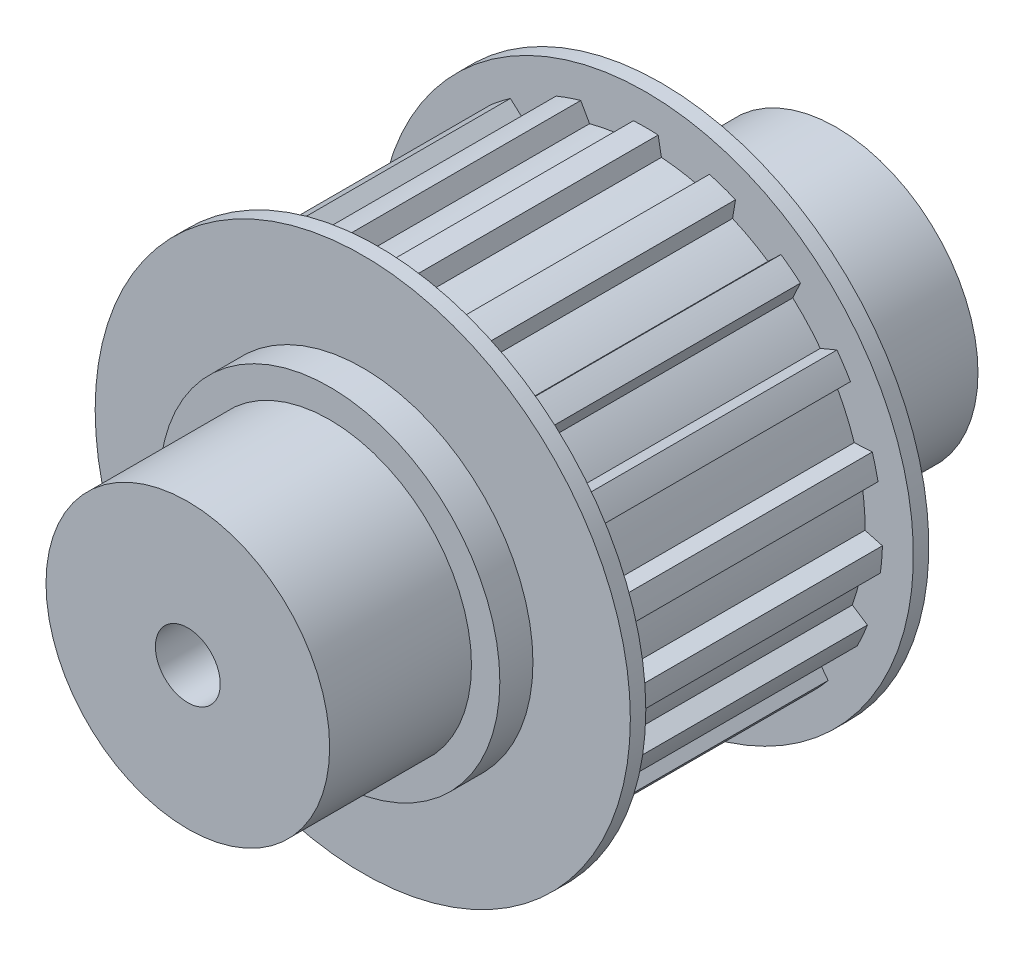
ISO-10303-21;
HEADER;
FILE_DESCRIPTION(('STEP AP214'),'2;1');
FILE_NAME('part.step','',(''),(''),'','','');
FILE_SCHEMA(('AUTOMOTIVE_DESIGN { 1 0 10303 214 1 1 1 1 }'));
ENDSEC;
DATA;
#1=APPLICATION_CONTEXT('core data for automotive mechanical design processes');
#2=APPLICATION_PROTOCOL_DEFINITION('international standard','automotive_design',2000,#1);
#3=PRODUCT_CONTEXT('',#1,'mechanical');
#4=PRODUCT('Part','Part','',(#3));
#5=PRODUCT_RELATED_PRODUCT_CATEGORY('part','',(#4));
#6=PRODUCT_DEFINITION_FORMATION('','',#4);
#7=PRODUCT_DEFINITION_CONTEXT('part definition',#1,'design');
#8=PRODUCT_DEFINITION('design','',#6,#7);
#9=PRODUCT_DEFINITION_SHAPE('','',#8);
#10=(LENGTH_UNIT() NAMED_UNIT(*) SI_UNIT(.MILLI.,.METRE.));
#11=(NAMED_UNIT(*) PLANE_ANGLE_UNIT() SI_UNIT($,.RADIAN.));
#12=(NAMED_UNIT(*) SI_UNIT($,.STERADIAN.) SOLID_ANGLE_UNIT());
#13=UNCERTAINTY_MEASURE_WITH_UNIT(LENGTH_MEASURE(1.E-05),#10,'distance_accuracy_value','');
#14=(GEOMETRIC_REPRESENTATION_CONTEXT(3) GLOBAL_UNCERTAINTY_ASSIGNED_CONTEXT((#13)) GLOBAL_UNIT_ASSIGNED_CONTEXT((#10,
#11,#12)) REPRESENTATION_CONTEXT('',''));
#15=CARTESIAN_POINT('',(0.,0.,0.));
#16=DIRECTION('',(0.,0.,1.));
#17=DIRECTION('',(1.,0.,0.));
#18=AXIS2_PLACEMENT_3D('',#15,#16,#17);
#19=CARTESIAN_POINT('',(21.42,21.42,-22.5));
#20=DIRECTION('',(0.,0.,1.));
#21=DIRECTION('',(-1.,0.,0.));
#22=AXIS2_PLACEMENT_3D('',#19,#20,#21);
#23=PLANE('',#22);
#24=CARTESIAN_POINT('',(0.,0.,-22.5));
#25=DIRECTION('',(0.,0.,-1.));
#26=DIRECTION('',(0.,1.,0.));
#27=AXIS2_PLACEMENT_3D('',#24,#25,#26);
#28=CIRCLE('',#27,17.5);
#29=CARTESIAN_POINT('',(0.,17.5,-22.5));
#30=VERTEX_POINT('',#29);
#31=EDGE_CURVE('E1024',#30,#30,#28,.T.);
#32=ORIENTED_EDGE('',*,*,#31,.F.);
#33=EDGE_LOOP('',(#32));
#34=FACE_BOUND('',#33,.T.);
#35=CARTESIAN_POINT('',(0.,0.,-22.5));
#36=DIRECTION('',(0.,0.,-1.));
#37=DIRECTION('',(0.,1.,0.));
#38=AXIS2_PLACEMENT_3D('',#35,#36,#37);
#39=CIRCLE('',#38,21.);
#40=CARTESIAN_POINT('',(0.,21.,-22.5));
#41=VERTEX_POINT('',#40);
#42=EDGE_CURVE('E19',#41,#41,#39,.F.);
#43=ORIENTED_EDGE('',*,*,#42,.F.);
#44=EDGE_LOOP('',(#43));
#45=FACE_BOUND('',#44,.T.);
#46=ADVANCED_FACE('F15',(#34,#45),#23,.F.);
#47=CARTESIAN_POINT('',(0.,0.,-18.415));
#48=DIRECTION('',(0.,0.,-1.));
#49=DIRECTION('',(0.,1.,0.));
#50=AXIS2_PLACEMENT_3D('',#47,#48,#49);
#51=CYLINDRICAL_SURFACE('',#50,21.);
#52=CARTESIAN_POINT('',(0.,0.,-18.415));
#53=DIRECTION('',(0.,0.,-1.));
#54=DIRECTION('',(0.,1.,0.));
#55=AXIS2_PLACEMENT_3D('',#52,#53,#54);
#56=CIRCLE('',#55,21.);
#57=CARTESIAN_POINT('',(0.,21.,-18.415));
#58=VERTEX_POINT('',#57);
#59=EDGE_CURVE('E1022',#58,#58,#56,.T.);
#60=ORIENTED_EDGE('',*,*,#59,.T.);
#61=EDGE_LOOP('',(#60));
#62=FACE_BOUND('',#61,.T.);
#63=ORIENTED_EDGE('',*,*,#42,.T.);
#64=EDGE_LOOP('',(#63));
#65=FACE_BOUND('',#64,.T.);
#66=ADVANCED_FACE('F1031',(#62,#65),#51,.T.);
#67=CARTESIAN_POINT('',(0.,0.,-22.5));
#68=DIRECTION('',(0.,0.,-1.));
#69=DIRECTION('',(0.,1.,0.));
#70=AXIS2_PLACEMENT_3D('',#67,#68,#69);
#71=CYLINDRICAL_SURFACE('',#70,17.5);
#72=ORIENTED_EDGE('',*,*,#31,.T.);
#73=EDGE_LOOP('',(#72));
#74=FACE_BOUND('',#73,.T.);
#75=CARTESIAN_POINT('',(0.,0.,-40.));
#76=DIRECTION('',(0.,0.,-1.));
#77=DIRECTION('',(0.,1.,0.));
#78=AXIS2_PLACEMENT_3D('',#75,#76,#77);
#79=CIRCLE('',#78,17.5);
#80=CARTESIAN_POINT('',(0.,17.5,-40.));
#81=VERTEX_POINT('',#80);
#82=EDGE_CURVE('E1019',#81,#81,#79,.F.);
#83=ORIENTED_EDGE('',*,*,#82,.T.);
#84=EDGE_LOOP('',(#83));
#85=FACE_BOUND('',#84,.T.);
#86=ADVANCED_FACE('F1040',(#74,#85),#71,.T.);
#87=CARTESIAN_POINT('',(33.6804,33.6804,-18.415));
#88=DIRECTION('',(0.,0.,1.));
#89=DIRECTION('',(-1.,0.,0.));
#90=AXIS2_PLACEMENT_3D('',#87,#88,#89);
#91=PLANE('',#90);
#92=ORIENTED_EDGE('',*,*,#59,.F.);
#93=EDGE_LOOP('',(#92));
#94=FACE_BOUND('',#93,.T.);
#95=CARTESIAN_POINT('',(0.,0.,-18.415));
#96=DIRECTION('',(0.,0.,-1.));
#97=DIRECTION('',(0.,1.,0.));
#98=AXIS2_PLACEMENT_3D('',#95,#96,#97);
#99=CIRCLE('',#98,33.02);
#100=CARTESIAN_POINT('',(0.,33.02,-18.415));
#101=VERTEX_POINT('',#100);
#102=EDGE_CURVE('E1016',#101,#101,#99,.F.);
#103=ORIENTED_EDGE('',*,*,#102,.F.);
#104=EDGE_LOOP('',(#103));
#105=FACE_BOUND('',#104,.T.);
#106=ADVANCED_FACE('F1391',(#94,#105),#91,.F.);
#107=CARTESIAN_POINT('',(17.85,17.85,-40.));
#108=DIRECTION('',(0.,0.,1.));
#109=DIRECTION('',(-1.,0.,0.));
#110=AXIS2_PLACEMENT_3D('',#107,#108,#109);
#111=PLANE('',#110);
#112=CARTESIAN_POINT('',(0.,0.,-40.));
#113=DIRECTION('',(0.,0.,-1.));
#114=DIRECTION('',(-1.,0.,0.));
#115=AXIS2_PLACEMENT_3D('',#112,#113,#114);
#116=CIRCLE('',#115,4.);
#117=CARTESIAN_POINT('',(-4.,0.,-40.));
#118=VERTEX_POINT('',#117);
#119=EDGE_CURVE('E1013',#118,#118,#116,.F.);
#120=ORIENTED_EDGE('',*,*,#119,.T.);
#121=EDGE_LOOP('',(#120));
#122=FACE_BOUND('',#121,.T.);
#123=ORIENTED_EDGE('',*,*,#82,.F.);
#124=EDGE_LOOP('',(#123));
#125=FACE_BOUND('',#124,.T.);
#126=ADVANCED_FACE('F1383',(#122,#125),#111,.F.);
#127=CARTESIAN_POINT('',(0.,0.,-16.51));
#128=DIRECTION('',(0.,0.,-1.));
#129=DIRECTION('',(0.,1.,0.));
#130=AXIS2_PLACEMENT_3D('',#127,#128,#129);
#131=CYLINDRICAL_SURFACE('',#130,33.02);
#132=CARTESIAN_POINT('',(0.,0.,-16.51));
#133=DIRECTION('',(0.,0.,-1.));
#134=DIRECTION('',(0.,1.,0.));
#135=AXIS2_PLACEMENT_3D('',#132,#133,#134);
#136=CIRCLE('',#135,33.02);
#137=CARTESIAN_POINT('',(0.,33.02,-16.51));
#138=VERTEX_POINT('',#137);
#139=EDGE_CURVE('E1010',#138,#138,#136,.F.);
#140=ORIENTED_EDGE('',*,*,#139,.F.);
#141=EDGE_LOOP('',(#140));
#142=FACE_BOUND('',#141,.T.);
#143=ORIENTED_EDGE('',*,*,#102,.T.);
#144=EDGE_LOOP('',(#143));
#145=FACE_BOUND('',#144,.T.);
#146=ADVANCED_FACE('F1377',(#142,#145),#131,.T.);
#147=CARTESIAN_POINT('',(0.,0.,40.));
#148=DIRECTION('',(0.,0.,-1.));
#149=DIRECTION('',(-1.,0.,0.));
#150=AXIS2_PLACEMENT_3D('',#147,#148,#149);
#151=CYLINDRICAL_SURFACE('',#150,4.);
#152=CARTESIAN_POINT('',(0.,0.,40.));
#153=DIRECTION('',(0.,0.,-1.));
#154=DIRECTION('',(-1.,0.,0.));
#155=AXIS2_PLACEMENT_3D('',#152,#153,#154);
#156=CIRCLE('',#155,4.);
#157=CARTESIAN_POINT('',(-4.,0.,40.));
#158=VERTEX_POINT('',#157);
#159=EDGE_CURVE('E506',#158,#158,#156,.F.);
#160=ORIENTED_EDGE('',*,*,#159,.T.);
#161=EDGE_LOOP('',(#160));
#162=FACE_BOUND('',#161,.T.);
#163=ORIENTED_EDGE('',*,*,#119,.F.);
#164=EDGE_LOOP('',(#163));
#165=FACE_BOUND('',#164,.T.);
#166=ADVANCED_FACE('F1375',(#162,#165),#151,.F.);
#167=CARTESIAN_POINT('',(33.6804,33.6804,-16.51));
#168=DIRECTION('',(0.,0.,1.));
#169=DIRECTION('',(-1.,0.,0.));
#170=AXIS2_PLACEMENT_3D('',#167,#168,#169);
#171=PLANE('',#170);
#172=CARTESIAN_POINT('',(0.,0.,-16.51));
#173=DIRECTION('',(0.,0.,1.));
#174=DIRECTION('',(1.,0.,0.));
#175=AXIS2_PLACEMENT_3D('',#172,#173,#174);
#176=CIRCLE('',#175,27.0509993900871);
#177=CARTESIAN_POINT('',(-1.92741928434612,26.9822464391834,-16.51));
#178=VERTEX_POINT('',#177);
#179=CARTESIAN_POINT('',(-6.93813470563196,26.1461059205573,-16.51));
#180=VERTEX_POINT('',#179);
#181=EDGE_CURVE('E806',#178,#180,#176,.T.);
#182=ORIENTED_EDGE('',*,*,#181,.F.);
#183=DIRECTION('',(-0.181324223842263,-0.983423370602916,0.));
#184=VECTOR('',#183,1.);
#185=CARTESIAN_POINT('',(-1.92741928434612,26.9822464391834,-16.51));
#186=LINE('',#185,#184);
#187=CARTESIAN_POINT('',(-1.524,29.1702163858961,-16.51));
#188=VERTEX_POINT('',#187);
#189=EDGE_CURVE('E501',#188,#178,#186,.T.);
#190=ORIENTED_EDGE('',*,*,#189,.F.);
#191=CARTESIAN_POINT('',(0.,0.,-16.51));
#192=DIRECTION('',(0.,0.,1.));
#193=DIRECTION('',(1.,0.,0.));
#194=AXIS2_PLACEMENT_3D('',#191,#192,#193);
#195=CIRCLE('',#194,29.21);
#196=CARTESIAN_POINT('',(1.524,29.1702163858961,-16.51));
#197=VERTEX_POINT('',#196);
#198=EDGE_CURVE('E498',#197,#188,#195,.T.);
#199=ORIENTED_EDGE('',*,*,#198,.F.);
#200=DIRECTION('',(-0.181324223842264,0.983423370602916,0.));
#201=VECTOR('',#200,1.);
#202=CARTESIAN_POINT('',(1.524,29.1702163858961,-16.51));
#203=LINE('',#202,#201);
#204=CARTESIAN_POINT('',(1.92741928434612,26.9822464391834,-16.51));
#205=VERTEX_POINT('',#204);
#206=EDGE_CURVE('E486',#205,#197,#203,.T.);
#207=ORIENTED_EDGE('',*,*,#206,.F.);
#208=CARTESIAN_POINT('',(0.,0.,-16.51));
#209=DIRECTION('',(0.,0.,1.));
#210=DIRECTION('',(1.,0.,0.));
#211=AXIS2_PLACEMENT_3D('',#208,#209,#210);
#212=CIRCLE('',#211,27.0509993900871);
#213=CARTESIAN_POINT('',(6.93813470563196,26.1461059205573,-16.51));
#214=VERTEX_POINT('',#213);
#215=EDGE_CURVE('E521',#214,#205,#212,.T.);
#216=ORIENTED_EDGE('',*,*,#215,.F.);
#217=DIRECTION('',(-0.417295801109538,-0.908770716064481,0.));
#218=VECTOR('',#217,1.);
#219=CARTESIAN_POINT('',(6.93813470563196,26.1461059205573,-16.51));
#220=LINE('',#219,#218);
#221=CARTESIAN_POINT('',(7.85141826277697,28.1350196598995,-16.51));
#222=VERTEX_POINT('',#221);
#223=EDGE_CURVE('E522',#222,#214,#220,.T.);
#224=ORIENTED_EDGE('',*,*,#223,.F.);
#225=CARTESIAN_POINT('',(0.,0.,-16.51));
#226=DIRECTION('',(0.,0.,1.));
#227=DIRECTION('',(1.,0.,0.));
#228=AXIS2_PLACEMENT_3D('',#225,#226,#227);
#229=CIRCLE('',#228,29.21);
#230=CARTESIAN_POINT('',(11.0725078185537,27.0300512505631,-16.51));
#231=VERTEX_POINT('',#230);
#232=EDGE_CURVE('E526',#231,#222,#229,.T.);
#233=ORIENTED_EDGE('',*,*,#232,.F.);
#234=DIRECTION('',(0.164594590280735,0.986361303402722,0.));
#235=VECTOR('',#234,1.);
#236=CARTESIAN_POINT('',(11.0725078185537,27.0300512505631,-16.51));
#237=LINE('',#236,#235);
#238=CARTESIAN_POINT('',(10.7073348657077,24.8416897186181,-16.51));
#239=VERTEX_POINT('',#238);
#240=EDGE_CURVE('E530',#239,#231,#237,.T.);
#241=ORIENTED_EDGE('',*,*,#240,.F.);
#242=CARTESIAN_POINT('',(0.,0.,-16.51));
#243=DIRECTION('',(0.,0.,1.));
#244=DIRECTION('',(1.,0.,0.));
#245=AXIS2_PLACEMENT_3D('',#242,#243,#244);
#246=CIRCLE('',#245,27.0509993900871);
#247=CARTESIAN_POINT('',(15.0844039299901,22.4547840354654,-16.51));
#248=VERTEX_POINT('',#247);
#249=EDGE_CURVE('E534',#248,#239,#246,.T.);
#250=ORIENTED_EDGE('',*,*,#249,.F.);
#251=DIRECTION('',(-0.724166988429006,-0.689624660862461,0.));
#252=VECTOR('',#251,1.);
#253=CARTESIAN_POINT('',(15.0844039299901,22.4547840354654,-16.51));
#254=LINE('',#253,#252);
#255=CARTESIAN_POINT('',(16.6829866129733,23.9771152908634,-16.51));
#256=VERTEX_POINT('',#255);
#257=EDGE_CURVE('E538',#256,#248,#254,.T.);
#258=ORIENTED_EDGE('',*,*,#257,.F.);
#259=CARTESIAN_POINT('',(0.,0.,-16.51));
#260=DIRECTION('',(0.,0.,1.));
#261=DIRECTION('',(1.,0.,0.));
#262=AXIS2_PLACEMENT_3D('',#259,#260,#261);
#263=CIRCLE('',#262,29.21);
#264=CARTESIAN_POINT('',(19.07738962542,22.1196135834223,-16.51));
#265=VERTEX_POINT('',#264);
#266=EDGE_CURVE('E542',#265,#256,#263,.T.);
#267=ORIENTED_EDGE('',*,*,#266,.F.);
#268=DIRECTION('',(0.417295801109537,0.908770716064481,0.));
#269=VECTOR('',#268,1.);
#270=CARTESIAN_POINT('',(19.07738962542,22.1196135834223,-16.51));
#271=LINE('',#270,#269);
#272=CARTESIAN_POINT('',(18.1364655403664,20.0705053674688,-16.51));
#273=VERTEX_POINT('',#272);
#274=EDGE_CURVE('E546',#273,#265,#271,.T.);
#275=ORIENTED_EDGE('',*,*,#274,.F.);
#276=CARTESIAN_POINT('',(0.,0.,-16.51));
#277=DIRECTION('',(0.,0.,1.));
#278=DIRECTION('',(1.,0.,0.));
#279=AXIS2_PLACEMENT_3D('',#276,#277,#278);
#280=CIRCLE('',#279,27.0509993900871);
#281=CARTESIAN_POINT('',(21.5344337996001,16.3714608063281,-16.51));
#282=VERTEX_POINT('',#281);
#283=EDGE_CURVE('E550',#282,#273,#280,.T.);
#284=ORIENTED_EDGE('',*,*,#283,.F.);
#285=DIRECTION('',(-0.922464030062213,-0.3860830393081,0.));
#286=VECTOR('',#285,1.);
#287=CARTESIAN_POINT('',(21.5344337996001,16.3714608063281,-16.51));
#288=LINE('',#287,#286);
#289=CARTESIAN_POINT('',(23.586778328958,17.2304378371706,-16.51));
#290=VERTEX_POINT('',#289);
#291=EDGE_CURVE('E554',#290,#282,#288,.T.);
#292=ORIENTED_EDGE('',*,*,#291,.F.);
#293=CARTESIAN_POINT('',(0.,0.,-16.51));
#294=DIRECTION('',(0.,0.,1.));
#295=DIRECTION('',(1.,0.,0.));
#296=AXIS2_PLACEMENT_3D('',#293,#294,#295);
#297=CIRCLE('',#296,29.21);
#298=CARTESIAN_POINT('',(25.2542665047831,14.6780830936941,-16.51));
#299=VERTEX_POINT('',#298);
#300=EDGE_CURVE('E558',#299,#290,#297,.T.);
#301=ORIENTED_EDGE('',*,*,#300,.F.);
#302=DIRECTION('',(0.724166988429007,0.68962466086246,0.));
#303=VECTOR('',#302,1.);
#304=CARTESIAN_POINT('',(25.2542665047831,14.6780830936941,-16.51));
#305=LINE('',#304,#303);
#306=CARTESIAN_POINT('',(23.6431241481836,13.1437912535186,-16.51));
#307=VERTEX_POINT('',#306);
#308=EDGE_CURVE('E562',#307,#299,#305,.T.);
#309=ORIENTED_EDGE('',*,*,#308,.F.);
#310=CARTESIAN_POINT('',(0.,0.,-16.51));
#311=DIRECTION('',(0.,0.,1.));
#312=DIRECTION('',(1.,0.,0.));
#313=AXIS2_PLACEMENT_3D('',#310,#311,#312);
#314=CIRCLE('',#313,27.0509993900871);
#315=CARTESIAN_POINT('',(25.7165817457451,8.39130450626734,-16.51));
#316=VERTEX_POINT('',#315);
#317=EDGE_CURVE('E566',#316,#307,#314,.T.);
#318=ORIENTED_EDGE('',*,*,#317,.F.);
#319=DIRECTION('',(-0.998638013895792,-0.052173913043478,0.));
#320=VECTOR('',#319,1.);
#321=CARTESIAN_POINT('',(25.7165817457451,8.39130450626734,-16.51));
#322=LINE('',#321,#320);
#323=CARTESIAN_POINT('',(27.9435845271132,8.50765442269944,-16.51));
#324=VERTEX_POINT('',#323);
#325=EDGE_CURVE('E570',#324,#316,#322,.T.);
#326=ORIENTED_EDGE('',*,*,#325,.F.);
#327=CARTESIAN_POINT('',(0.,0.,-16.51));
#328=DIRECTION('',(0.,0.,1.));
#329=DIRECTION('',(1.,0.,0.));
#330=AXIS2_PLACEMENT_3D('',#327,#328,#329);
#331=CIRCLE('',#330,29.21);
#332=CARTESIAN_POINT('',(28.651735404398,5.68349877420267,-16.51));
#333=VERTEX_POINT('',#332);
#334=EDGE_CURVE('E574',#333,#324,#331,.T.);
#335=ORIENTED_EDGE('',*,*,#334,.F.);
#336=DIRECTION('',(0.908818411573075,0.417191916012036,0.));
#337=VECTOR('',#336,1.);
#338=CARTESIAN_POINT('',(28.6517354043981,5.68349877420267,-16.51));
#339=LINE('',#338,#337);
#340=CARTESIAN_POINT('',(26.6297503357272,4.7553091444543,-16.51));
#341=VERTEX_POINT('',#340);
#342=EDGE_CURVE('E578',#341,#333,#339,.T.);
#343=ORIENTED_EDGE('',*,*,#342,.F.);
#344=CARTESIAN_POINT('',(0.,0.,-16.51));
#345=DIRECTION('',(0.,0.,1.));
#346=DIRECTION('',(1.,0.,0.));
#347=AXIS2_PLACEMENT_3D('',#344,#345,#346);
#348=CIRCLE('',#347,27.0509993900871);
#349=CARTESIAN_POINT('',(27.0492602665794,-0.306736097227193,-16.51));
#350=VERTEX_POINT('',#349);
#351=EDGE_CURVE('E582',#350,#341,#348,.T.);
#352=ORIENTED_EDGE('',*,*,#351,.F.);
#353=DIRECTION('',(-0.965110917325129,0.261841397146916,0.));
#354=VECTOR('',#353,1.);
#355=CARTESIAN_POINT('',(27.0492602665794,-0.306736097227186,-16.51));
#356=LINE('',#355,#354);
#357=CARTESIAN_POINT('',(29.1964598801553,-0.889286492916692,-16.51));
#358=VERTEX_POINT('',#357);
#359=EDGE_CURVE('E586',#358,#350,#356,.T.);
#360=ORIENTED_EDGE('',*,*,#359,.F.);
#361=CARTESIAN_POINT('',(0.,0.,-16.51));
#362=DIRECTION('',(0.,0.,1.));
#363=DIRECTION('',(1.,0.,0.));
#364=AXIS2_PLACEMENT_3D('',#361,#362,#363);
#365=CIRCLE('',#364,29.21);
#366=CARTESIAN_POINT('',(28.9447343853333,-3.92765214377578,-16.51));
#367=VERTEX_POINT('',#366);
#368=EDGE_CURVE('E590',#367,#358,#365,.T.);
#369=ORIENTED_EDGE('',*,*,#368,.F.);
#370=DIRECTION('',(0.997458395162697,0.071251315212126,0.));
#371=VECTOR('',#370,1.);
#372=CARTESIAN_POINT('',(28.9447343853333,-3.92765214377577,-16.51));
#373=LINE('',#372,#371);
#374=CARTESIAN_POINT('',(26.7407671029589,-4.08508785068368,-16.51));
#375=VERTEX_POINT('',#374);
#376=EDGE_CURVE('E594',#375,#367,#373,.T.);
#377=ORIENTED_EDGE('',*,*,#376,.F.);
#378=CARTESIAN_POINT('',(0.,0.,-16.51));
#379=DIRECTION('',(0.,0.,1.));
#380=DIRECTION('',(1.,0.,0.));
#381=AXIS2_PLACEMENT_3D('',#378,#379,#380);
#382=CIRCLE('',#381,27.0509993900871);
#383=CARTESIAN_POINT('',(25.4838570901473,-9.0735657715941,-16.51));
#384=VERTEX_POINT('',#383);
#385=EDGE_CURVE('E598',#384,#375,#382,.T.);
#386=ORIENTED_EDGE('',*,*,#385,.F.);
#387=DIRECTION('',(-0.836967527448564,0.547252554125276,0.));
#388=VECTOR('',#387,1.);
#389=CARTESIAN_POINT('',(25.4838570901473,-9.0735657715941,-16.51));
#390=LINE('',#389,#388);
#391=CARTESIAN_POINT('',(27.3388530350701,-10.2864578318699,-16.51));
#392=VERTEX_POINT('',#391);
#393=EDGE_CURVE('E602',#392,#384,#390,.T.);
#394=ORIENTED_EDGE('',*,*,#393,.F.);
#395=CARTESIAN_POINT('',(0.,0.,-16.51));
#396=DIRECTION('',(0.,0.,1.));
#397=DIRECTION('',(1.,0.,0.));
#398=AXIS2_PLACEMENT_3D('',#395,#396,#397);
#399=CIRCLE('',#398,29.21);
#400=CARTESIAN_POINT('',(26.084094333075,-13.1470195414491,-16.51));
#401=VERTEX_POINT('',#400);
#402=EDGE_CURVE('E606',#401,#392,#399,.T.);
#403=ORIENTED_EDGE('',*,*,#402,.F.);
#404=DIRECTION('',(0.965110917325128,-0.261841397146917,0.));
#405=VECTOR('',#404,1.);
#406=CARTESIAN_POINT('',(26.084094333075,-13.1470195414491,-16.51));
#407=LINE('',#406,#405);
#408=CARTESIAN_POINT('',(23.9536332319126,-12.5690104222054,-16.51));
#409=VERTEX_POINT('',#408);
#410=EDGE_CURVE('E610',#409,#401,#407,.T.);
#411=ORIENTED_EDGE('',*,*,#410,.F.);
#412=CARTESIAN_POINT('',(0.,0.,-16.51));
#413=DIRECTION('',(0.,0.,1.));
#414=DIRECTION('',(1.,0.,0.));
#415=AXIS2_PLACEMENT_3D('',#412,#413,#414);
#416=CIRCLE('',#415,27.0509993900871);
#417=CARTESIAN_POINT('',(21.1568894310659,-16.8565298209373,-16.51));
#418=VERTEX_POINT('',#417);
#419=EDGE_CURVE('E614',#418,#409,#416,.T.);
#420=ORIENTED_EDGE('',*,*,#419,.F.);
#421=DIRECTION('',(-0.600720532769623,0.799459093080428,0.));
#422=VECTOR('',#421,1.);
#423=CARTESIAN_POINT('',(21.1568894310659,-16.8565298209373,-16.51));
#424=LINE('',#423,#422);
#425=CARTESIAN_POINT('',(22.4934027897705,-18.6352067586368,-16.51));
#426=VERTEX_POINT('',#425);
#427=EDGE_CURVE('E618',#426,#418,#424,.T.);
#428=ORIENTED_EDGE('',*,*,#427,.F.);
#429=CARTESIAN_POINT('',(0.,0.,-16.51));
#430=DIRECTION('',(0.,0.,1.));
#431=DIRECTION('',(1.,0.,0.));
#432=AXIS2_PLACEMENT_3D('',#429,#430,#431);
#433=CIRCLE('',#432,29.21);
#434=CARTESIAN_POINT('',(20.4290485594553,-20.8776932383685,-16.51));
#435=VERTEX_POINT('',#434);
#436=EDGE_CURVE('E622',#435,#426,#433,.T.);
#437=ORIENTED_EDGE('',*,*,#436,.F.);
#438=DIRECTION('',(0.846335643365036,-0.532649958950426,0.));
#439=VECTOR('',#438,1.);
#440=CARTESIAN_POINT('',(20.4290485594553,-20.8776932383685,-16.51));
#441=LINE('',#440,#439);
#442=CARTESIAN_POINT('',(18.5460783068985,-19.6926267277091,-16.51));
#443=VERTEX_POINT('',#442);
#444=EDGE_CURVE('E626',#443,#435,#441,.T.);
#445=ORIENTED_EDGE('',*,*,#444,.F.);
#446=CARTESIAN_POINT('',(0.,0.,-16.51));
#447=DIRECTION('',(0.,0.,1.));
#448=DIRECTION('',(1.,0.,0.));
#449=AXIS2_PLACEMENT_3D('',#446,#447,#448);
#450=CIRCLE('',#449,27.0509993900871);
#451=CARTESIAN_POINT('',(14.5372445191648,-22.8128273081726,-16.51));
#452=VERTEX_POINT('',#451);
#453=EDGE_CURVE('E630',#452,#443,#450,.T.);
#454=ORIENTED_EDGE('',*,*,#453,.F.);
#455=DIRECTION('',(-0.308587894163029,0.951195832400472,0.));
#456=VECTOR('',#455,1.);
#457=CARTESIAN_POINT('',(14.5372445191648,-22.8128273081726,-16.51));
#458=LINE('',#457,#456);
#459=CARTESIAN_POINT('',(15.2238064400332,-24.9290958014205,-16.51));
#460=VERTEX_POINT('',#459);
#461=EDGE_CURVE('E634',#460,#452,#458,.T.);
#462=ORIENTED_EDGE('',*,*,#461,.F.);
#463=CARTESIAN_POINT('',(0.,0.,-16.51));
#464=DIRECTION('',(0.,0.,1.));
#465=DIRECTION('',(1.,0.,0.));
#466=AXIS2_PLACEMENT_3D('',#463,#464,#465);
#467=CIRCLE('',#466,29.21);
#468=CARTESIAN_POINT('',(12.5431704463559,-26.3797834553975,-16.51));
#469=VERTEX_POINT('',#468);
#470=EDGE_CURVE('E638',#469,#460,#467,.T.);
#471=ORIENTED_EDGE('',*,*,#470,.F.);
#472=DIRECTION('',(0.62752768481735,-0.77859424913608,0.));
#473=VECTOR('',#472,1.);
#474=CARTESIAN_POINT('',(12.5431704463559,-26.3797834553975,-16.51));
#475=LINE('',#474,#473);
#476=CARTESIAN_POINT('',(11.1470151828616,-24.6475276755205,-16.51));
#477=VERTEX_POINT('',#476);
#478=EDGE_CURVE('E642',#477,#469,#475,.T.);
#479=ORIENTED_EDGE('',*,*,#478,.F.);
#480=CARTESIAN_POINT('',(0.,0.,-16.51));
#481=DIRECTION('',(0.,0.,1.));
#482=DIRECTION('',(1.,0.,0.));
#483=AXIS2_PLACEMENT_3D('',#480,#481,#482);
#484=CIRCLE('',#483,27.0509993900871);
#485=CARTESIAN_POINT('',(6.34226359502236,-26.2970009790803,-16.51));
#486=VERTEX_POINT('',#485);
#487=EDGE_CURVE('E646',#486,#477,#484,.T.);
#488=ORIENTED_EDGE('',*,*,#487,.F.);
#489=DIRECTION('',(0.016985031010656,0.99985574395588,0.));
#490=VECTOR('',#489,1.);
#491=CARTESIAN_POINT('',(6.34226359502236,-26.2970009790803,-16.51));
#492=LINE('',#491,#490);
#493=CARTESIAN_POINT('',(6.30447444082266,-28.5215304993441,-16.51));
#494=VERTEX_POINT('',#493);
#495=EDGE_CURVE('E650',#494,#486,#492,.T.);
#496=ORIENTED_EDGE('',*,*,#495,.F.);
#497=CARTESIAN_POINT('',(0.,0.,-16.51));
#498=DIRECTION('',(0.,0.,1.));
#499=DIRECTION('',(1.,0.,0.));
#500=AXIS2_PLACEMENT_3D('',#497,#498,#499);
#501=CIRCLE('',#500,29.21);
#502=CARTESIAN_POINT('',(3.29804518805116,-29.0232148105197,-16.51));
#503=VERTEX_POINT('',#502);
#504=EDGE_CURVE('E654',#503,#494,#501,.T.);
#505=ORIENTED_EDGE('',*,*,#504,.F.);
#506=DIRECTION('',(0.34071736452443,-0.940165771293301,0.));
#507=VECTOR('',#506,1.);
#508=CARTESIAN_POINT('',(3.29804518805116,-29.0232148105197,-16.51));
#509=LINE('',#508,#507);
#510=CARTESIAN_POINT('',(2.54,-26.9314865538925,-16.51));
#511=VERTEX_POINT('',#510);
#512=EDGE_CURVE('E658',#511,#503,#509,.T.);
#513=ORIENTED_EDGE('',*,*,#512,.F.);
#514=CARTESIAN_POINT('',(0.,0.,-16.51));
#515=DIRECTION('',(0.,0.,1.));
#516=DIRECTION('',(1.,0.,0.));
#517=AXIS2_PLACEMENT_3D('',#514,#515,#516);
#518=CIRCLE('',#517,27.0509993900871);
#519=CARTESIAN_POINT('',(-2.54000000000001,-26.9314865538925,-16.51));
#520=VERTEX_POINT('',#519);
#521=EDGE_CURVE('E662',#520,#511,#518,.T.);
#522=ORIENTED_EDGE('',*,*,#521,.F.);
#523=DIRECTION('',(0.340717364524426,0.940165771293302,0.));
#524=VECTOR('',#523,1.);
#525=CARTESIAN_POINT('',(-2.54000000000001,-26.9314865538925,-16.51));
#526=LINE('',#525,#524);
#527=CARTESIAN_POINT('',(-3.29804518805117,-29.0232148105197,-16.51));
#528=VERTEX_POINT('',#527);
#529=EDGE_CURVE('E666',#528,#520,#526,.T.);
#530=ORIENTED_EDGE('',*,*,#529,.F.);
#531=CARTESIAN_POINT('',(0.,0.,-16.51));
#532=DIRECTION('',(0.,0.,1.));
#533=DIRECTION('',(1.,0.,0.));
#534=AXIS2_PLACEMENT_3D('',#531,#532,#533);
#535=CIRCLE('',#534,29.21);
#536=CARTESIAN_POINT('',(-6.30447444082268,-28.5215304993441,-16.51));
#537=VERTEX_POINT('',#536);
#538=EDGE_CURVE('E670',#537,#528,#535,.T.);
#539=ORIENTED_EDGE('',*,*,#538,.F.);
#540=DIRECTION('',(0.016985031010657,-0.99985574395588,0.));
#541=VECTOR('',#540,1.);
#542=CARTESIAN_POINT('',(-6.30447444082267,-28.5215304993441,-16.51));
#543=LINE('',#542,#541);
#544=CARTESIAN_POINT('',(-6.34226359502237,-26.2970009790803,-16.51));
#545=VERTEX_POINT('',#544);
#546=EDGE_CURVE('E674',#545,#537,#543,.T.);
#547=ORIENTED_EDGE('',*,*,#546,.F.);
#548=CARTESIAN_POINT('',(0.,0.,-16.51));
#549=DIRECTION('',(0.,0.,1.));
#550=DIRECTION('',(1.,0.,0.));
#551=AXIS2_PLACEMENT_3D('',#548,#549,#550);
#552=CIRCLE('',#551,27.0509993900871);
#553=CARTESIAN_POINT('',(-11.1827363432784,-24.6313413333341,-16.51));
#554=VERTEX_POINT('',#553);
#555=EDGE_CURVE('E678',#554,#545,#552,.T.);
#556=ORIENTED_EDGE('',*,*,#555,.F.);
#557=DIRECTION('',(0.600781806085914,0.799413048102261,0.));
#558=VECTOR('',#557,1.);
#559=CARTESIAN_POINT('',(-11.1827363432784,-24.6313413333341,-16.51));
#560=LINE('',#559,#558);
#561=CARTESIAN_POINT('',(-12.5089489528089,-26.3960280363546,-16.51));
#562=VERTEX_POINT('',#561);
#563=EDGE_CURVE('E682',#562,#554,#560,.T.);
#564=ORIENTED_EDGE('',*,*,#563,.F.);
#565=CARTESIAN_POINT('',(0.,0.,-16.51));
#566=DIRECTION('',(0.,0.,1.));
#567=DIRECTION('',(1.,0.,0.));
#568=AXIS2_PLACEMENT_3D('',#565,#566,#567);
#569=CIRCLE('',#568,29.21);
#570=CARTESIAN_POINT('',(-15.2238064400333,-24.9290958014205,-16.51));
#571=VERTEX_POINT('',#570);
#572=EDGE_CURVE('E686',#571,#562,#569,.T.);
#573=ORIENTED_EDGE('',*,*,#572,.F.);
#574=DIRECTION('',(-0.308587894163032,-0.951195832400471,0.));
#575=VECTOR('',#574,1.);
#576=CARTESIAN_POINT('',(-15.2238064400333,-24.9290958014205,-16.51));
#577=LINE('',#576,#575);
#578=CARTESIAN_POINT('',(-14.5372445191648,-22.8128273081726,-16.51));
#579=VERTEX_POINT('',#578);
#580=EDGE_CURVE('E690',#579,#571,#577,.T.);
#581=ORIENTED_EDGE('',*,*,#580,.F.);
#582=CARTESIAN_POINT('',(0.,0.,-16.51));
#583=DIRECTION('',(0.,0.,1.));
#584=DIRECTION('',(1.,0.,0.));
#585=AXIS2_PLACEMENT_3D('',#582,#583,#584);
#586=CIRCLE('',#585,27.0509993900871);
#587=CARTESIAN_POINT('',(-18.5460783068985,-19.6926267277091,-16.51));
#588=VERTEX_POINT('',#587);
#589=EDGE_CURVE('E694',#588,#579,#586,.T.);
#590=ORIENTED_EDGE('',*,*,#589,.F.);
#591=DIRECTION('',(0.846335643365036,0.532649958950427,0.));
#592=VECTOR('',#591,1.);
#593=CARTESIAN_POINT('',(-18.5460783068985,-19.6926267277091,-16.51));
#594=LINE('',#593,#592);
#595=CARTESIAN_POINT('',(-20.4290485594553,-20.8776932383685,-16.51));
#596=VERTEX_POINT('',#595);
#597=EDGE_CURVE('E698',#596,#588,#594,.T.);
#598=ORIENTED_EDGE('',*,*,#597,.F.);
#599=CARTESIAN_POINT('',(0.,0.,-16.51));
#600=DIRECTION('',(0.,0.,1.));
#601=DIRECTION('',(1.,0.,0.));
#602=AXIS2_PLACEMENT_3D('',#599,#600,#601);
#603=CIRCLE('',#602,29.21);
#604=CARTESIAN_POINT('',(-22.4938981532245,-18.6346088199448,-16.51));
#605=VERTEX_POINT('',#604);
#606=EDGE_CURVE('E702',#605,#596,#603,.T.);
#607=ORIENTED_EDGE('',*,*,#606,.F.);
#608=DIRECTION('',(-0.600781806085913,-0.799413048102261,0.));
#609=VECTOR('',#608,1.);
#610=CARTESIAN_POINT('',(-22.4938981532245,-18.6346088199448,-16.51));
#611=LINE('',#610,#609);
#612=CARTESIAN_POINT('',(-21.1572658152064,-16.8560574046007,-16.51));
#613=VERTEX_POINT('',#612);
#614=EDGE_CURVE('E706',#613,#605,#611,.T.);
#615=ORIENTED_EDGE('',*,*,#614,.F.);
#616=CARTESIAN_POINT('',(0.,0.,-16.51));
#617=DIRECTION('',(0.,0.,1.));
#618=DIRECTION('',(1.,0.,0.));
#619=AXIS2_PLACEMENT_3D('',#616,#617,#618);
#620=CIRCLE('',#619,27.0509993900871);
#621=CARTESIAN_POINT('',(-23.9353860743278,-12.6037241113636,-16.51));
#622=VERTEX_POINT('',#621);
#623=EDGE_CURVE('E710',#622,#613,#620,.T.);
#624=ORIENTED_EDGE('',*,*,#623,.F.);
#625=DIRECTION('',(0.97343000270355,0.228984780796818,0.));
#626=VECTOR('',#625,1.);
#627=CARTESIAN_POINT('',(-23.9353860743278,-12.6037241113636,-16.51));
#628=LINE('',#627,#626);
#629=CARTESIAN_POINT('',(-26.1011222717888,-13.1131810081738,-16.51));
#630=VERTEX_POINT('',#629);
#631=EDGE_CURVE('E714',#630,#622,#628,.T.);
#632=ORIENTED_EDGE('',*,*,#631,.F.);
#633=CARTESIAN_POINT('',(0.,0.,-16.51));
#634=DIRECTION('',(0.,0.,1.));
#635=DIRECTION('',(1.,0.,0.));
#636=AXIS2_PLACEMENT_3D('',#633,#634,#635);
#637=CIRCLE('',#636,29.21);
#638=CARTESIAN_POINT('',(-27.325489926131,-10.3219039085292,-16.51));
#639=VERTEX_POINT('',#638);
#640=EDGE_CURVE('E718',#639,#630,#637,.T.);
#641=ORIENTED_EDGE('',*,*,#640,.F.);
#642=DIRECTION('',(-0.827755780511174,-0.561088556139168,0.));
#643=VECTOR('',#642,1.);
#644=CARTESIAN_POINT('',(-27.325489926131,-10.3219039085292,-16.51));
#645=LINE('',#644,#643);
#646=CARTESIAN_POINT('',(-25.4838570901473,-9.07356577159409,-16.51));
#647=VERTEX_POINT('',#646);
#648=EDGE_CURVE('E722',#647,#639,#645,.T.);
#649=ORIENTED_EDGE('',*,*,#648,.F.);
#650=CARTESIAN_POINT('',(0.,0.,-16.51));
#651=DIRECTION('',(0.,0.,1.));
#652=DIRECTION('',(1.,0.,0.));
#653=AXIS2_PLACEMENT_3D('',#650,#651,#652);
#654=CIRCLE('',#653,27.0509993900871);
#655=CARTESIAN_POINT('',(-26.7308307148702,-4.14960929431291,-16.51));
#656=VERTEX_POINT('',#655);
#657=EDGE_CURVE('E726',#656,#647,#654,.T.);
#658=ORIENTED_EDGE('',*,*,#657,.F.);
#659=DIRECTION('',(0.995045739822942,-0.099418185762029,0.));
#660=VECTOR('',#659,1.);
#661=CARTESIAN_POINT('',(-26.7308307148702,-4.14960929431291,-16.51));
#662=LINE('',#661,#660);
#663=CARTESIAN_POINT('',(-28.9446299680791,-3.92842156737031,-16.51));
#664=VERTEX_POINT('',#663);
#665=EDGE_CURVE('E730',#664,#656,#662,.T.);
#666=ORIENTED_EDGE('',*,*,#665,.F.);
#667=CARTESIAN_POINT('',(0.,0.,-16.51));
#668=DIRECTION('',(0.,0.,1.));
#669=DIRECTION('',(1.,0.,0.));
#670=AXIS2_PLACEMENT_3D('',#667,#668,#669);
#671=CIRCLE('',#670,29.21);
#672=CARTESIAN_POINT('',(-29.1964362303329,-0.890062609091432,-16.51));
#673=VERTEX_POINT('',#672);
#674=EDGE_CURVE('E734',#673,#664,#671,.T.);
#675=ORIENTED_EDGE('',*,*,#674,.F.);
#676=DIRECTION('',(-0.965090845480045,-0.261915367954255,0.));
#677=VECTOR('',#676,1.);
#678=CARTESIAN_POINT('',(-29.1964362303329,-0.890062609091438,-16.51));
#679=LINE('',#678,#677);
#680=CARTESIAN_POINT('',(-27.0492534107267,-0.30734008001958,-16.51));
#681=VERTEX_POINT('',#680);
#682=EDGE_CURVE('E738',#681,#673,#679,.T.);
#683=ORIENTED_EDGE('',*,*,#682,.F.);
#684=CARTESIAN_POINT('',(0.,0.,-16.51));
#685=DIRECTION('',(0.,0.,1.));
#686=DIRECTION('',(1.,0.,0.));
#687=AXIS2_PLACEMENT_3D('',#684,#685,#686);
#688=CIRCLE('',#687,27.0509993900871);
#689=CARTESIAN_POINT('',(-26.6295919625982,4.75619594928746,-16.51));
#690=VERTEX_POINT('',#689);
#691=EDGE_CURVE('E742',#690,#681,#688,.T.);
#692=ORIENTED_EDGE('',*,*,#691,.F.);
#693=DIRECTION('',(0.908770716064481,-0.417295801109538,0.));
#694=VECTOR('',#693,1.);
#695=CARTESIAN_POINT('',(-26.6295919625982,4.75619594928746,-16.51));
#696=LINE('',#695,#694);
#697=CARTESIAN_POINT('',(-28.651510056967,5.68463468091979,-16.51));
#698=VERTEX_POINT('',#697);
#699=EDGE_CURVE('E746',#698,#690,#696,.T.);
#700=ORIENTED_EDGE('',*,*,#699,.F.);
#701=CARTESIAN_POINT('',(0.,0.,-16.51));
#702=DIRECTION('',(0.,0.,1.));
#703=DIRECTION('',(1.,0.,0.));
#704=AXIS2_PLACEMENT_3D('',#701,#702,#703);
#705=CIRCLE('',#704,29.21);
#706=CARTESIAN_POINT('',(-27.8922695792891,8.67441051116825,-16.51));
#707=VERTEX_POINT('',#706);
#708=EDGE_CURVE('E750',#707,#698,#705,.T.);
#709=ORIENTED_EDGE('',*,*,#708,.F.);
#710=DIRECTION('',(-0.995045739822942,0.099418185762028,0.));
#711=VECTOR('',#710,1.);
#712=CARTESIAN_POINT('',(-27.8922695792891,8.67441051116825,-16.51));
#713=LINE('',#712,#711);
#714=CARTESIAN_POINT('',(-25.6957280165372,8.4549470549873,-16.51));
#715=VERTEX_POINT('',#714);
#716=EDGE_CURVE('E754',#715,#707,#713,.T.);
#717=ORIENTED_EDGE('',*,*,#716,.F.);
#718=CARTESIAN_POINT('',(0.,0.,-16.51));
#719=DIRECTION('',(0.,0.,1.));
#720=DIRECTION('',(1.,0.,0.));
#721=AXIS2_PLACEMENT_3D('',#718,#719,#720);
#722=CIRCLE('',#721,27.0509993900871);
#723=CARTESIAN_POINT('',(-23.6428306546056,13.1443191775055,-16.51));
#724=VERTEX_POINT('',#723);
#725=EDGE_CURVE('E758',#724,#715,#722,.T.);
#726=ORIENTED_EDGE('',*,*,#725,.F.);
#727=DIRECTION('',(0.724114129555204,-0.689680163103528,0.));
#728=VECTOR('',#727,1.);
#729=CARTESIAN_POINT('',(-23.6428306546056,13.1443191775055,-16.51));
#730=LINE('',#729,#728);
#731=CARTESIAN_POINT('',(-25.2538763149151,14.6787544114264,-16.51));
#732=VERTEX_POINT('',#731);
#733=EDGE_CURVE('E762',#732,#724,#730,.T.);
#734=ORIENTED_EDGE('',*,*,#733,.F.);
#735=CARTESIAN_POINT('',(0.,0.,-16.51));
#736=DIRECTION('',(0.,0.,1.));
#737=DIRECTION('',(1.,0.,0.));
#738=AXIS2_PLACEMENT_3D('',#735,#736,#737);
#739=CIRCLE('',#738,29.21);
#740=CARTESIAN_POINT('',(-23.5867783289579,17.2304378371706,-16.51));
#741=VERTEX_POINT('',#740);
#742=EDGE_CURVE('E766',#741,#732,#739,.T.);
#743=ORIENTED_EDGE('',*,*,#742,.F.);
#744=DIRECTION('',(-0.922464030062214,0.3860830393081,0.));
#745=VECTOR('',#744,1.);
#746=CARTESIAN_POINT('',(-23.5867783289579,17.2304378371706,-16.51));
#747=LINE('',#746,#745);
#748=CARTESIAN_POINT('',(-21.5344337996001,16.3714608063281,-16.51));
#749=VERTEX_POINT('',#748);
#750=EDGE_CURVE('E770',#749,#741,#747,.T.);
#751=ORIENTED_EDGE('',*,*,#750,.F.);
#752=CARTESIAN_POINT('',(0.,0.,-16.51));
#753=DIRECTION('',(0.,0.,1.));
#754=DIRECTION('',(1.,0.,0.));
#755=AXIS2_PLACEMENT_3D('',#752,#753,#754);
#756=CIRCLE('',#755,27.0509993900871);
#757=CARTESIAN_POINT('',(-18.0938434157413,20.1089382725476,-16.51));
#758=VERTEX_POINT('',#757);
#759=EDGE_CURVE('E774',#758,#749,#756,.T.);
#760=ORIENTED_EDGE('',*,*,#759,.F.);
#761=DIRECTION('',(0.460940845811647,-0.887430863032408,0.));
#762=VECTOR('',#761,1.);
#763=CARTESIAN_POINT('',(-18.0938434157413,20.1089382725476,-16.51));
#764=LINE('',#763,#762);
#765=CARTESIAN_POINT('',(-19.1193678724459,22.08333924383,-16.51));
#766=VERTEX_POINT('',#765);
#767=EDGE_CURVE('E778',#766,#758,#764,.T.);
#768=ORIENTED_EDGE('',*,*,#767,.F.);
#769=CARTESIAN_POINT('',(0.,0.,-16.51));
#770=DIRECTION('',(0.,0.,1.));
#771=DIRECTION('',(1.,0.,0.));
#772=AXIS2_PLACEMENT_3D('',#769,#770,#771);
#773=CIRCLE('',#772,29.21);
#774=CARTESIAN_POINT('',(-16.7140675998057,23.9554595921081,-16.51));
#775=VERTEX_POINT('',#774);
#776=EDGE_CURVE('E782',#775,#766,#773,.T.);
#777=ORIENTED_EDGE('',*,*,#776,.F.);
#778=DIRECTION('',(-0.747121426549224,0.664687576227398,0.));
#779=VECTOR('',#778,1.);
#780=CARTESIAN_POINT('',(-16.7140675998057,23.9554595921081,-16.51));
#781=LINE('',#780,#779);
#782=CARTESIAN_POINT('',(-15.0518341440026,22.4766291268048,-16.51));
#783=VERTEX_POINT('',#782);
#784=EDGE_CURVE('E786',#783,#775,#781,.T.);
#785=ORIENTED_EDGE('',*,*,#784,.F.);
#786=CARTESIAN_POINT('',(0.,0.,-16.51));
#787=DIRECTION('',(0.,0.,1.));
#788=DIRECTION('',(1.,0.,0.));
#789=AXIS2_PLACEMENT_3D('',#786,#787,#788);
#790=CIRCLE('',#789,27.0509993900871);
#791=CARTESIAN_POINT('',(-10.7073348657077,24.8416897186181,-16.51));
#792=VERTEX_POINT('',#791);
#793=EDGE_CURVE('E790',#792,#783,#790,.T.);
#794=ORIENTED_EDGE('',*,*,#793,.F.);
#795=DIRECTION('',(0.164594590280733,-0.986361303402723,0.));
#796=VECTOR('',#795,1.);
#797=CARTESIAN_POINT('',(-10.7073348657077,24.8416897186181,-16.51));
#798=LINE('',#797,#796);
#799=CARTESIAN_POINT('',(-11.0725078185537,27.0300512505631,-16.51));
#800=VERTEX_POINT('',#799);
#801=EDGE_CURVE('E794',#800,#792,#798,.T.);
#802=ORIENTED_EDGE('',*,*,#801,.F.);
#803=CARTESIAN_POINT('',(0.,0.,-16.51));
#804=DIRECTION('',(0.,0.,1.));
#805=DIRECTION('',(1.,0.,0.));
#806=AXIS2_PLACEMENT_3D('',#803,#804,#805);
#807=CIRCLE('',#806,29.21);
#808=CARTESIAN_POINT('',(-8.03012830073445,28.0845355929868,-16.51));
#809=VERTEX_POINT('',#808);
#810=EDGE_CURVE('E798',#809,#800,#807,.T.);
#811=ORIENTED_EDGE('',*,*,#810,.F.);
#812=DIRECTION('',(-0.490816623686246,0.871262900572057,0.));
#813=VECTOR('',#812,1.);
#814=CARTESIAN_POINT('',(-8.03012830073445,28.0845355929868,-16.51));
#815=LINE('',#814,#813);
#816=EDGE_CURVE('E802',#180,#809,#815,.T.);
#817=ORIENTED_EDGE('',*,*,#816,.F.);
#818=EDGE_LOOP('',(#182,#190,#199,#207,#216,#224,#233,#241,#250,#258,#267,#275,#284,#292,#301,
#309,#318,#326,#335,#343,#352,#360,#369,#377,#386,#394,#403,#411,#420,#428,#437,#445,#454,#462,
#471,#479,#488,#496,#505,#513,#522,#530,#539,#547,#556,#564,#573,#581,#590,#598,#607,#615,#624,
#632,#641,#649,#658,#666,#675,#683,#692,#700,#709,#717,#726,#734,#743,#751,#760,#768,#777,#785,
#794,#802,#811,#817));
#819=FACE_BOUND('',#818,.T.);
#820=ORIENTED_EDGE('',*,*,#139,.T.);
#821=EDGE_LOOP('',(#820));
#822=FACE_BOUND('',#821,.T.);
#823=ADVANCED_FACE('F17',(#819,#822),#171,.T.);
#824=CARTESIAN_POINT('',(0.,0.,40.));
#825=DIRECTION('',(0.,0.,-1.));
#826=DIRECTION('',(-1.,0.,0.));
#827=AXIS2_PLACEMENT_3D('',#824,#825,#826);
#828=PLANE('',#827);
#829=ORIENTED_EDGE('',*,*,#159,.F.);
#830=EDGE_LOOP('',(#829));
#831=FACE_BOUND('',#830,.T.);
#832=CARTESIAN_POINT('',(0.,0.,40.));
#833=DIRECTION('',(0.,0.,1.));
#834=DIRECTION('',(1.,0.,0.));
#835=AXIS2_PLACEMENT_3D('',#832,#833,#834);
#836=CIRCLE('',#835,17.5);
#837=CARTESIAN_POINT('',(17.5,0.,40.));
#838=VERTEX_POINT('',#837);
#839=EDGE_CURVE('E511',#838,#838,#836,.F.);
#840=ORIENTED_EDGE('',*,*,#839,.F.);
#841=EDGE_LOOP('',(#840));
#842=FACE_BOUND('',#841,.T.);
#843=ADVANCED_FACE('F1372',(#831,#842),#828,.F.);
#844=CARTESIAN_POINT('',(0.,0.,0.));
#845=DIRECTION('',(0.,0.,1.));
#846=DIRECTION('',(1.,0.,0.));
#847=AXIS2_PLACEMENT_3D('',#844,#845,#846);
#848=CYLINDRICAL_SURFACE('',#847,29.21);
#849=ORIENTED_EDGE('',*,*,#198,.T.);
#850=DIRECTION('',(0.,0.,1.));
#851=VECTOR('',#850,1.);
#852=CARTESIAN_POINT('',(-1.524,29.1702163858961,0.));
#853=LINE('',#852,#851);
#854=CARTESIAN_POINT('',(-1.524,29.1702163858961,16.51));
#855=VERTEX_POINT('',#854);
#856=EDGE_CURVE('E505',#855,#188,#853,.F.);
#857=ORIENTED_EDGE('',*,*,#856,.F.);
#858=CARTESIAN_POINT('',(0.,0.,16.51));
#859=DIRECTION('',(0.,0.,1.));
#860=DIRECTION('',(1.,0.,0.));
#861=AXIS2_PLACEMENT_3D('',#858,#859,#860);
#862=CIRCLE('',#861,29.21);
#863=CARTESIAN_POINT('',(1.524,29.1702163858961,16.51));
#864=VERTEX_POINT('',#863);
#865=EDGE_CURVE('E510',#864,#855,#862,.T.);
#866=ORIENTED_EDGE('',*,*,#865,.F.);
#867=DIRECTION('',(0.,0.,1.));
#868=VECTOR('',#867,1.);
#869=CARTESIAN_POINT('',(1.524,29.1702163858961,0.));
#870=LINE('',#869,#868);
#871=EDGE_CURVE('E491',#197,#864,#870,.T.);
#872=ORIENTED_EDGE('',*,*,#871,.F.);
#873=EDGE_LOOP('',(#849,#857,#866,#872));
#874=FACE_BOUND('',#873,.T.);
#875=ADVANCED_FACE('F509',(#874),#848,.T.);
#876=CARTESIAN_POINT('',(-1.92741928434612,26.9822464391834,0.));
#877=DIRECTION('',(-0.983423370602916,0.181324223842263,0.));
#878=DIRECTION('',(-0.181324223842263,-0.983423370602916,0.));
#879=AXIS2_PLACEMENT_3D('',#876,#877,#878);
#880=PLANE('',#879);
#881=ORIENTED_EDGE('',*,*,#189,.T.);
#882=DIRECTION('',(0.,0.,1.));
#883=VECTOR('',#882,1.);
#884=CARTESIAN_POINT('',(-1.92741928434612,26.9822464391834,0.));
#885=LINE('',#884,#883);
#886=CARTESIAN_POINT('',(-1.92741928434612,26.9822464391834,16.51));
#887=VERTEX_POINT('',#886);
#888=EDGE_CURVE('E807',#887,#178,#885,.F.);
#889=ORIENTED_EDGE('',*,*,#888,.F.);
#890=DIRECTION('',(-0.181324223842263,-0.983423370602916,0.));
#891=VECTOR('',#890,1.);
#892=CARTESIAN_POINT('',(-1.524,29.1702163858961,16.51));
#893=LINE('',#892,#891);
#894=EDGE_CURVE('E969',#855,#887,#893,.T.);
#895=ORIENTED_EDGE('',*,*,#894,.F.);
#896=ORIENTED_EDGE('',*,*,#856,.T.);
#897=EDGE_LOOP('',(#881,#889,#895,#896));
#898=FACE_BOUND('',#897,.T.);
#899=ADVANCED_FACE('F1365',(#898),#880,.T.);
#900=CARTESIAN_POINT('',(0.,0.,0.));
#901=DIRECTION('',(0.,0.,1.));
#902=DIRECTION('',(1.,0.,0.));
#903=AXIS2_PLACEMENT_3D('',#900,#901,#902);
#904=CYLINDRICAL_SURFACE('',#903,27.0509993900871);
#905=ORIENTED_EDGE('',*,*,#181,.T.);
#906=DIRECTION('',(0.,0.,1.));
#907=VECTOR('',#906,1.);
#908=CARTESIAN_POINT('',(-6.93813470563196,26.1461059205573,0.));
#909=LINE('',#908,#907);
#910=CARTESIAN_POINT('',(-6.93813470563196,26.1461059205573,16.51));
#911=VERTEX_POINT('',#910);
#912=EDGE_CURVE('E803',#911,#180,#909,.F.);
#913=ORIENTED_EDGE('',*,*,#912,.F.);
#914=CARTESIAN_POINT('',(0.,0.,16.51));
#915=DIRECTION('',(0.,0.,1.));
#916=DIRECTION('',(1.,0.,0.));
#917=AXIS2_PLACEMENT_3D('',#914,#915,#916);
#918=CIRCLE('',#917,27.0509993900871);
#919=EDGE_CURVE('E967',#887,#911,#918,.T.);
#920=ORIENTED_EDGE('',*,*,#919,.F.);
#921=ORIENTED_EDGE('',*,*,#888,.T.);
#922=EDGE_LOOP('',(#905,#913,#920,#921));
#923=FACE_BOUND('',#922,.T.);
#924=ADVANCED_FACE('F1361',(#923),#904,.T.);
#925=CARTESIAN_POINT('',(-8.03012830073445,28.0845355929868,0.));
#926=DIRECTION('',(0.871262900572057,0.490816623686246,0.));
#927=DIRECTION('',(-0.490816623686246,0.871262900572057,0.));
#928=AXIS2_PLACEMENT_3D('',#925,#926,#927);
#929=PLANE('',#928);
#930=ORIENTED_EDGE('',*,*,#816,.T.);
#931=DIRECTION('',(0.,0.,1.));
#932=VECTOR('',#931,1.);
#933=CARTESIAN_POINT('',(-8.03012830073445,28.0845355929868,0.));
#934=LINE('',#933,#932);
#935=CARTESIAN_POINT('',(-8.03012830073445,28.0845355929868,16.51));
#936=VERTEX_POINT('',#935);
#937=EDGE_CURVE('E799',#936,#809,#934,.F.);
#938=ORIENTED_EDGE('',*,*,#937,.F.);
#939=DIRECTION('',(-0.490816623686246,0.871262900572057,0.));
#940=VECTOR('',#939,1.);
#941=CARTESIAN_POINT('',(-6.93813470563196,26.1461059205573,16.51));
#942=LINE('',#941,#940);
#943=EDGE_CURVE('E966',#911,#936,#942,.T.);
#944=ORIENTED_EDGE('',*,*,#943,.F.);
#945=ORIENTED_EDGE('',*,*,#912,.T.);
#946=EDGE_LOOP('',(#930,#938,#944,#945));
#947=FACE_BOUND('',#946,.T.);
#948=ADVANCED_FACE('F1357',(#947),#929,.T.);
#949=CARTESIAN_POINT('',(0.,0.,0.));
#950=DIRECTION('',(0.,0.,1.));
#951=DIRECTION('',(1.,0.,0.));
#952=AXIS2_PLACEMENT_3D('',#949,#950,#951);
#953=CYLINDRICAL_SURFACE('',#952,29.21);
#954=ORIENTED_EDGE('',*,*,#810,.T.);
#955=DIRECTION('',(0.,0.,1.));
#956=VECTOR('',#955,1.);
#957=CARTESIAN_POINT('',(-11.0725078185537,27.0300512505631,0.));
#958=LINE('',#957,#956);
#959=CARTESIAN_POINT('',(-11.0725078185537,27.0300512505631,16.51));
#960=VERTEX_POINT('',#959);
#961=EDGE_CURVE('E795',#960,#800,#958,.F.);
#962=ORIENTED_EDGE('',*,*,#961,.F.);
#963=CARTESIAN_POINT('',(0.,0.,16.51));
#964=DIRECTION('',(0.,0.,1.));
#965=DIRECTION('',(1.,0.,0.));
#966=AXIS2_PLACEMENT_3D('',#963,#964,#965);
#967=CIRCLE('',#966,29.21);
#968=EDGE_CURVE('E964',#936,#960,#967,.T.);
#969=ORIENTED_EDGE('',*,*,#968,.F.);
#970=ORIENTED_EDGE('',*,*,#937,.T.);
#971=EDGE_LOOP('',(#954,#962,#969,#970));
#972=FACE_BOUND('',#971,.T.);
#973=ADVANCED_FACE('F1353',(#972),#953,.T.);
#974=CARTESIAN_POINT('',(-10.7073348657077,24.8416897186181,0.));
#975=DIRECTION('',(-0.986361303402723,-0.164594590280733,0.));
#976=DIRECTION('',(0.164594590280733,-0.986361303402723,0.));
#977=AXIS2_PLACEMENT_3D('',#974,#975,#976);
#978=PLANE('',#977);
#979=ORIENTED_EDGE('',*,*,#801,.T.);
#980=DIRECTION('',(0.,0.,1.));
#981=VECTOR('',#980,1.);
#982=CARTESIAN_POINT('',(-10.7073348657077,24.8416897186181,0.));
#983=LINE('',#982,#981);
#984=CARTESIAN_POINT('',(-10.7073348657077,24.8416897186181,16.51));
#985=VERTEX_POINT('',#984);
#986=EDGE_CURVE('E791',#985,#792,#983,.F.);
#987=ORIENTED_EDGE('',*,*,#986,.F.);
#988=DIRECTION('',(0.164594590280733,-0.986361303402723,0.));
#989=VECTOR('',#988,1.);
#990=CARTESIAN_POINT('',(-11.0725078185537,27.0300512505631,16.51));
#991=LINE('',#990,#989);
#992=EDGE_CURVE('E963',#960,#985,#991,.T.);
#993=ORIENTED_EDGE('',*,*,#992,.F.);
#994=ORIENTED_EDGE('',*,*,#961,.T.);
#995=EDGE_LOOP('',(#979,#987,#993,#994));
#996=FACE_BOUND('',#995,.T.);
#997=ADVANCED_FACE('F1349',(#996),#978,.T.);
#998=CARTESIAN_POINT('',(0.,0.,0.));
#999=DIRECTION('',(0.,0.,1.));
#1000=DIRECTION('',(1.,0.,0.));
#1001=AXIS2_PLACEMENT_3D('',#998,#999,#1000);
#1002=CYLINDRICAL_SURFACE('',#1001,27.0509993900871);
#1003=ORIENTED_EDGE('',*,*,#793,.T.);
#1004=DIRECTION('',(0.,0.,1.));
#1005=VECTOR('',#1004,1.);
#1006=CARTESIAN_POINT('',(-15.0518341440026,22.4766291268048,0.));
#1007=LINE('',#1006,#1005);
#1008=CARTESIAN_POINT('',(-15.0518341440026,22.4766291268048,16.51));
#1009=VERTEX_POINT('',#1008);
#1010=EDGE_CURVE('E787',#1009,#783,#1007,.F.);
#1011=ORIENTED_EDGE('',*,*,#1010,.F.);
#1012=CARTESIAN_POINT('',(0.,0.,16.51));
#1013=DIRECTION('',(0.,0.,1.));
#1014=DIRECTION('',(1.,0.,0.));
#1015=AXIS2_PLACEMENT_3D('',#1012,#1013,#1014);
#1016=CIRCLE('',#1015,27.0509993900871);
#1017=EDGE_CURVE('E961',#985,#1009,#1016,.T.);
#1018=ORIENTED_EDGE('',*,*,#1017,.F.);
#1019=ORIENTED_EDGE('',*,*,#986,.T.);
#1020=EDGE_LOOP('',(#1003,#1011,#1018,#1019));
#1021=FACE_BOUND('',#1020,.T.);
#1022=ADVANCED_FACE('F1345',(#1021),#1002,.T.);
#1023=CARTESIAN_POINT('',(-16.7140675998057,23.9554595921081,0.));
#1024=DIRECTION('',(0.664687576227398,0.747121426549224,0.));
#1025=DIRECTION('',(-0.747121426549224,0.664687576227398,0.));
#1026=AXIS2_PLACEMENT_3D('',#1023,#1024,#1025);
#1027=PLANE('',#1026);
#1028=ORIENTED_EDGE('',*,*,#784,.T.);
#1029=DIRECTION('',(0.,0.,1.));
#1030=VECTOR('',#1029,1.);
#1031=CARTESIAN_POINT('',(-16.7140675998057,23.9554595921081,0.));
#1032=LINE('',#1031,#1030);
#1033=CARTESIAN_POINT('',(-16.7140675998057,23.9554595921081,16.51));
#1034=VERTEX_POINT('',#1033);
#1035=EDGE_CURVE('E783',#1034,#775,#1032,.F.);
#1036=ORIENTED_EDGE('',*,*,#1035,.F.);
#1037=DIRECTION('',(-0.747121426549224,0.664687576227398,0.));
#1038=VECTOR('',#1037,1.);
#1039=CARTESIAN_POINT('',(-15.0518341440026,22.4766291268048,16.51));
#1040=LINE('',#1039,#1038);
#1041=EDGE_CURVE('E960',#1009,#1034,#1040,.T.);
#1042=ORIENTED_EDGE('',*,*,#1041,.F.);
#1043=ORIENTED_EDGE('',*,*,#1010,.T.);
#1044=EDGE_LOOP('',(#1028,#1036,#1042,#1043));
#1045=FACE_BOUND('',#1044,.T.);
#1046=ADVANCED_FACE('F1341',(#1045),#1027,.T.);
#1047=CARTESIAN_POINT('',(0.,0.,0.));
#1048=DIRECTION('',(0.,0.,1.));
#1049=DIRECTION('',(1.,0.,0.));
#1050=AXIS2_PLACEMENT_3D('',#1047,#1048,#1049);
#1051=CYLINDRICAL_SURFACE('',#1050,29.21);
#1052=ORIENTED_EDGE('',*,*,#776,.T.);
#1053=DIRECTION('',(0.,0.,1.));
#1054=VECTOR('',#1053,1.);
#1055=CARTESIAN_POINT('',(-19.1193678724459,22.08333924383,0.));
#1056=LINE('',#1055,#1054);
#1057=CARTESIAN_POINT('',(-19.1193678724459,22.08333924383,16.51));
#1058=VERTEX_POINT('',#1057);
#1059=EDGE_CURVE('E779',#1058,#766,#1056,.F.);
#1060=ORIENTED_EDGE('',*,*,#1059,.F.);
#1061=CARTESIAN_POINT('',(0.,0.,16.51));
#1062=DIRECTION('',(0.,0.,1.));
#1063=DIRECTION('',(1.,0.,0.));
#1064=AXIS2_PLACEMENT_3D('',#1061,#1062,#1063);
#1065=CIRCLE('',#1064,29.21);
#1066=EDGE_CURVE('E958',#1034,#1058,#1065,.T.);
#1067=ORIENTED_EDGE('',*,*,#1066,.F.);
#1068=ORIENTED_EDGE('',*,*,#1035,.T.);
#1069=EDGE_LOOP('',(#1052,#1060,#1067,#1068));
#1070=FACE_BOUND('',#1069,.T.);
#1071=ADVANCED_FACE('F1337',(#1070),#1051,.T.);
#1072=CARTESIAN_POINT('',(-18.0938434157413,20.1089382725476,0.));
#1073=DIRECTION('',(-0.887430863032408,-0.460940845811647,0.));
#1074=DIRECTION('',(0.460940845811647,-0.887430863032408,0.));
#1075=AXIS2_PLACEMENT_3D('',#1072,#1073,#1074);
#1076=PLANE('',#1075);
#1077=ORIENTED_EDGE('',*,*,#767,.T.);
#1078=DIRECTION('',(0.,0.,1.));
#1079=VECTOR('',#1078,1.);
#1080=CARTESIAN_POINT('',(-18.0938434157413,20.1089382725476,0.));
#1081=LINE('',#1080,#1079);
#1082=CARTESIAN_POINT('',(-18.0938434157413,20.1089382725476,16.51));
#1083=VERTEX_POINT('',#1082);
#1084=EDGE_CURVE('E775',#1083,#758,#1081,.F.);
#1085=ORIENTED_EDGE('',*,*,#1084,.F.);
#1086=DIRECTION('',(0.460940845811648,-0.887430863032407,0.));
#1087=VECTOR('',#1086,1.);
#1088=CARTESIAN_POINT('',(-19.1193678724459,22.08333924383,16.51));
#1089=LINE('',#1088,#1087);
#1090=EDGE_CURVE('E957',#1058,#1083,#1089,.T.);
#1091=ORIENTED_EDGE('',*,*,#1090,.F.);
#1092=ORIENTED_EDGE('',*,*,#1059,.T.);
#1093=EDGE_LOOP('',(#1077,#1085,#1091,#1092));
#1094=FACE_BOUND('',#1093,.T.);
#1095=ADVANCED_FACE('F1333',(#1094),#1076,.T.);
#1096=CARTESIAN_POINT('',(0.,0.,0.));
#1097=DIRECTION('',(0.,0.,1.));
#1098=DIRECTION('',(1.,0.,0.));
#1099=AXIS2_PLACEMENT_3D('',#1096,#1097,#1098);
#1100=CYLINDRICAL_SURFACE('',#1099,27.0509993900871);
#1101=ORIENTED_EDGE('',*,*,#759,.T.);
#1102=DIRECTION('',(0.,0.,1.));
#1103=VECTOR('',#1102,1.);
#1104=CARTESIAN_POINT('',(-21.5344337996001,16.3714608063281,0.));
#1105=LINE('',#1104,#1103);
#1106=CARTESIAN_POINT('',(-21.5344337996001,16.3714608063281,16.51));
#1107=VERTEX_POINT('',#1106);
#1108=EDGE_CURVE('E771',#1107,#749,#1105,.F.);
#1109=ORIENTED_EDGE('',*,*,#1108,.F.);
#1110=CARTESIAN_POINT('',(0.,0.,16.51));
#1111=DIRECTION('',(0.,0.,1.));
#1112=DIRECTION('',(1.,0.,0.));
#1113=AXIS2_PLACEMENT_3D('',#1110,#1111,#1112);
#1114=CIRCLE('',#1113,27.0509993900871);
#1115=EDGE_CURVE('E955',#1083,#1107,#1114,.T.);
#1116=ORIENTED_EDGE('',*,*,#1115,.F.);
#1117=ORIENTED_EDGE('',*,*,#1084,.T.);
#1118=EDGE_LOOP('',(#1101,#1109,#1116,#1117));
#1119=FACE_BOUND('',#1118,.T.);
#1120=ADVANCED_FACE('F1329',(#1119),#1100,.T.);
#1121=CARTESIAN_POINT('',(-23.5867783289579,17.2304378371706,0.));
#1122=DIRECTION('',(0.3860830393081,0.922464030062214,0.));
#1123=DIRECTION('',(-0.922464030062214,0.3860830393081,0.));
#1124=AXIS2_PLACEMENT_3D('',#1121,#1122,#1123);
#1125=PLANE('',#1124);
#1126=ORIENTED_EDGE('',*,*,#750,.T.);
#1127=DIRECTION('',(0.,0.,1.));
#1128=VECTOR('',#1127,1.);
#1129=CARTESIAN_POINT('',(-23.5867783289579,17.2304378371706,0.));
#1130=LINE('',#1129,#1128);
#1131=CARTESIAN_POINT('',(-23.5867783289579,17.2304378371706,16.51));
#1132=VERTEX_POINT('',#1131);
#1133=EDGE_CURVE('E767',#1132,#741,#1130,.F.);
#1134=ORIENTED_EDGE('',*,*,#1133,.F.);
#1135=DIRECTION('',(-0.922464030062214,0.386083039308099,0.));
#1136=VECTOR('',#1135,1.);
#1137=CARTESIAN_POINT('',(-21.5344337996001,16.3714608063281,16.51));
#1138=LINE('',#1137,#1136);
#1139=EDGE_CURVE('E954',#1107,#1132,#1138,.T.);
#1140=ORIENTED_EDGE('',*,*,#1139,.F.);
#1141=ORIENTED_EDGE('',*,*,#1108,.T.);
#1142=EDGE_LOOP('',(#1126,#1134,#1140,#1141));
#1143=FACE_BOUND('',#1142,.T.);
#1144=ADVANCED_FACE('F1325',(#1143),#1125,.T.);
#1145=CARTESIAN_POINT('',(0.,0.,0.));
#1146=DIRECTION('',(0.,0.,1.));
#1147=DIRECTION('',(1.,0.,0.));
#1148=AXIS2_PLACEMENT_3D('',#1145,#1146,#1147);
#1149=CYLINDRICAL_SURFACE('',#1148,29.21);
#1150=ORIENTED_EDGE('',*,*,#742,.T.);
#1151=DIRECTION('',(0.,0.,1.));
#1152=VECTOR('',#1151,1.);
#1153=CARTESIAN_POINT('',(-25.2538763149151,14.6787544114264,0.));
#1154=LINE('',#1153,#1152);
#1155=CARTESIAN_POINT('',(-25.2538763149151,14.6787544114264,16.51));
#1156=VERTEX_POINT('',#1155);
#1157=EDGE_CURVE('E763',#1156,#732,#1154,.F.);
#1158=ORIENTED_EDGE('',*,*,#1157,.F.);
#1159=CARTESIAN_POINT('',(0.,0.,16.51));
#1160=DIRECTION('',(0.,0.,1.));
#1161=DIRECTION('',(1.,0.,0.));
#1162=AXIS2_PLACEMENT_3D('',#1159,#1160,#1161);
#1163=CIRCLE('',#1162,29.21);
#1164=EDGE_CURVE('E952',#1132,#1156,#1163,.T.);
#1165=ORIENTED_EDGE('',*,*,#1164,.F.);
#1166=ORIENTED_EDGE('',*,*,#1133,.T.);
#1167=EDGE_LOOP('',(#1150,#1158,#1165,#1166));
#1168=FACE_BOUND('',#1167,.T.);
#1169=ADVANCED_FACE('F1321',(#1168),#1149,.T.);
#1170=CARTESIAN_POINT('',(-23.6428306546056,13.1443191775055,0.));
#1171=DIRECTION('',(-0.689680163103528,-0.724114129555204,0.));
#1172=DIRECTION('',(0.724114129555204,-0.689680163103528,0.));
#1173=AXIS2_PLACEMENT_3D('',#1170,#1171,#1172);
#1174=PLANE('',#1173);
#1175=ORIENTED_EDGE('',*,*,#733,.T.);
#1176=DIRECTION('',(0.,0.,1.));
#1177=VECTOR('',#1176,1.);
#1178=CARTESIAN_POINT('',(-23.6428306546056,13.1443191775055,0.));
#1179=LINE('',#1178,#1177);
#1180=CARTESIAN_POINT('',(-23.6428306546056,13.1443191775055,16.51));
#1181=VERTEX_POINT('',#1180);
#1182=EDGE_CURVE('E759',#1181,#724,#1179,.F.);
#1183=ORIENTED_EDGE('',*,*,#1182,.F.);
#1184=DIRECTION('',(0.724114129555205,-0.689680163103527,0.));
#1185=VECTOR('',#1184,1.);
#1186=CARTESIAN_POINT('',(-25.2538763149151,14.6787544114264,16.51));
#1187=LINE('',#1186,#1185);
#1188=EDGE_CURVE('E951',#1156,#1181,#1187,.T.);
#1189=ORIENTED_EDGE('',*,*,#1188,.F.);
#1190=ORIENTED_EDGE('',*,*,#1157,.T.);
#1191=EDGE_LOOP('',(#1175,#1183,#1189,#1190));
#1192=FACE_BOUND('',#1191,.T.);
#1193=ADVANCED_FACE('F1317',(#1192),#1174,.T.);
#1194=CARTESIAN_POINT('',(0.,0.,0.));
#1195=DIRECTION('',(0.,0.,1.));
#1196=DIRECTION('',(1.,0.,0.));
#1197=AXIS2_PLACEMENT_3D('',#1194,#1195,#1196);
#1198=CYLINDRICAL_SURFACE('',#1197,27.0509993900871);
#1199=ORIENTED_EDGE('',*,*,#725,.T.);
#1200=DIRECTION('',(0.,0.,1.));
#1201=VECTOR('',#1200,1.);
#1202=CARTESIAN_POINT('',(-25.6957280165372,8.4549470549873,0.));
#1203=LINE('',#1202,#1201);
#1204=CARTESIAN_POINT('',(-25.6957280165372,8.4549470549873,16.51));
#1205=VERTEX_POINT('',#1204);
#1206=EDGE_CURVE('E755',#1205,#715,#1203,.F.);
#1207=ORIENTED_EDGE('',*,*,#1206,.F.);
#1208=CARTESIAN_POINT('',(0.,0.,16.51));
#1209=DIRECTION('',(0.,0.,1.));
#1210=DIRECTION('',(1.,0.,0.));
#1211=AXIS2_PLACEMENT_3D('',#1208,#1209,#1210);
#1212=CIRCLE('',#1211,27.0509993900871);
#1213=EDGE_CURVE('E949',#1181,#1205,#1212,.T.);
#1214=ORIENTED_EDGE('',*,*,#1213,.F.);
#1215=ORIENTED_EDGE('',*,*,#1182,.T.);
#1216=EDGE_LOOP('',(#1199,#1207,#1214,#1215));
#1217=FACE_BOUND('',#1216,.T.);
#1218=ADVANCED_FACE('F1313',(#1217),#1198,.T.);
#1219=CARTESIAN_POINT('',(-27.8922695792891,8.67441051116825,0.));
#1220=DIRECTION('',(0.099418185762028,0.995045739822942,0.));
#1221=DIRECTION('',(-0.995045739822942,0.099418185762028,0.));
#1222=AXIS2_PLACEMENT_3D('',#1219,#1220,#1221);
#1223=PLANE('',#1222);
#1224=ORIENTED_EDGE('',*,*,#716,.T.);
#1225=DIRECTION('',(0.,0.,1.));
#1226=VECTOR('',#1225,1.);
#1227=CARTESIAN_POINT('',(-27.8922695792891,8.67441051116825,0.));
#1228=LINE('',#1227,#1226);
#1229=CARTESIAN_POINT('',(-27.8922695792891,8.67441051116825,16.51));
#1230=VERTEX_POINT('',#1229);
#1231=EDGE_CURVE('E751',#1230,#707,#1228,.F.);
#1232=ORIENTED_EDGE('',*,*,#1231,.F.);
#1233=DIRECTION('',(-0.995045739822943,0.0994181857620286,0.));
#1234=VECTOR('',#1233,1.);
#1235=CARTESIAN_POINT('',(-25.6957280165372,8.4549470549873,16.51));
#1236=LINE('',#1235,#1234);
#1237=EDGE_CURVE('E948',#1205,#1230,#1236,.T.);
#1238=ORIENTED_EDGE('',*,*,#1237,.F.);
#1239=ORIENTED_EDGE('',*,*,#1206,.T.);
#1240=EDGE_LOOP('',(#1224,#1232,#1238,#1239));
#1241=FACE_BOUND('',#1240,.T.);
#1242=ADVANCED_FACE('F1309',(#1241),#1223,.T.);
#1243=CARTESIAN_POINT('',(0.,0.,0.));
#1244=DIRECTION('',(0.,0.,1.));
#1245=DIRECTION('',(1.,0.,0.));
#1246=AXIS2_PLACEMENT_3D('',#1243,#1244,#1245);
#1247=CYLINDRICAL_SURFACE('',#1246,29.21);
#1248=ORIENTED_EDGE('',*,*,#708,.T.);
#1249=DIRECTION('',(0.,0.,1.));
#1250=VECTOR('',#1249,1.);
#1251=CARTESIAN_POINT('',(-28.651510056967,5.68463468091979,0.));
#1252=LINE('',#1251,#1250);
#1253=CARTESIAN_POINT('',(-28.651510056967,5.68463468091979,16.51));
#1254=VERTEX_POINT('',#1253);
#1255=EDGE_CURVE('E747',#1254,#698,#1252,.F.);
#1256=ORIENTED_EDGE('',*,*,#1255,.F.);
#1257=CARTESIAN_POINT('',(0.,0.,16.51));
#1258=DIRECTION('',(0.,0.,1.));
#1259=DIRECTION('',(1.,0.,0.));
#1260=AXIS2_PLACEMENT_3D('',#1257,#1258,#1259);
#1261=CIRCLE('',#1260,29.21);
#1262=EDGE_CURVE('E946',#1230,#1254,#1261,.T.);
#1263=ORIENTED_EDGE('',*,*,#1262,.F.);
#1264=ORIENTED_EDGE('',*,*,#1231,.T.);
#1265=EDGE_LOOP('',(#1248,#1256,#1263,#1264));
#1266=FACE_BOUND('',#1265,.T.);
#1267=ADVANCED_FACE('F1305',(#1266),#1247,.T.);
#1268=CARTESIAN_POINT('',(-26.6295919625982,4.75619594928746,0.));
#1269=DIRECTION('',(-0.417295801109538,-0.908770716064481,0.));
#1270=DIRECTION('',(0.908770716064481,-0.417295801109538,0.));
#1271=AXIS2_PLACEMENT_3D('',#1268,#1269,#1270);
#1272=PLANE('',#1271);
#1273=ORIENTED_EDGE('',*,*,#699,.T.);
#1274=DIRECTION('',(0.,0.,1.));
#1275=VECTOR('',#1274,1.);
#1276=CARTESIAN_POINT('',(-26.6295919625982,4.75619594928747,0.));
#1277=LINE('',#1276,#1275);
#1278=CARTESIAN_POINT('',(-26.6295919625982,4.75619594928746,16.51));
#1279=VERTEX_POINT('',#1278);
#1280=EDGE_CURVE('E743',#1279,#690,#1277,.F.);
#1281=ORIENTED_EDGE('',*,*,#1280,.F.);
#1282=DIRECTION('',(0.90877071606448,-0.417295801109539,0.));
#1283=VECTOR('',#1282,1.);
#1284=CARTESIAN_POINT('',(-28.651510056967,5.68463468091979,16.51));
#1285=LINE('',#1284,#1283);
#1286=EDGE_CURVE('E945',#1254,#1279,#1285,.T.);
#1287=ORIENTED_EDGE('',*,*,#1286,.F.);
#1288=ORIENTED_EDGE('',*,*,#1255,.T.);
#1289=EDGE_LOOP('',(#1273,#1281,#1287,#1288));
#1290=FACE_BOUND('',#1289,.T.);
#1291=ADVANCED_FACE('F1301',(#1290),#1272,.T.);
#1292=CARTESIAN_POINT('',(0.,0.,0.));
#1293=DIRECTION('',(0.,0.,1.));
#1294=DIRECTION('',(1.,0.,0.));
#1295=AXIS2_PLACEMENT_3D('',#1292,#1293,#1294);
#1296=CYLINDRICAL_SURFACE('',#1295,27.0509993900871);
#1297=ORIENTED_EDGE('',*,*,#691,.T.);
#1298=DIRECTION('',(0.,0.,1.));
#1299=VECTOR('',#1298,1.);
#1300=CARTESIAN_POINT('',(-27.0492534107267,-0.30734008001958,0.));
#1301=LINE('',#1300,#1299);
#1302=CARTESIAN_POINT('',(-27.0492534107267,-0.30734008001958,16.51));
#1303=VERTEX_POINT('',#1302);
#1304=EDGE_CURVE('E739',#1303,#681,#1301,.F.);
#1305=ORIENTED_EDGE('',*,*,#1304,.F.);
#1306=CARTESIAN_POINT('',(0.,0.,16.51));
#1307=DIRECTION('',(0.,0.,1.));
#1308=DIRECTION('',(1.,0.,0.));
#1309=AXIS2_PLACEMENT_3D('',#1306,#1307,#1308);
#1310=CIRCLE('',#1309,27.0509993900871);
#1311=EDGE_CURVE('E943',#1279,#1303,#1310,.T.);
#1312=ORIENTED_EDGE('',*,*,#1311,.F.);
#1313=ORIENTED_EDGE('',*,*,#1280,.T.);
#1314=EDGE_LOOP('',(#1297,#1305,#1312,#1313));
#1315=FACE_BOUND('',#1314,.T.);
#1316=ADVANCED_FACE('F1297',(#1315),#1296,.T.);
#1317=CARTESIAN_POINT('',(-29.1964362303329,-0.890062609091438,0.));
#1318=DIRECTION('',(-0.261915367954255,0.965090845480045,0.));
#1319=DIRECTION('',(-0.965090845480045,-0.261915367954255,0.));
#1320=AXIS2_PLACEMENT_3D('',#1317,#1318,#1319);
#1321=PLANE('',#1320);
#1322=ORIENTED_EDGE('',*,*,#682,.T.);
#1323=DIRECTION('',(0.,0.,1.));
#1324=VECTOR('',#1323,1.);
#1325=CARTESIAN_POINT('',(-29.1964362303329,-0.890062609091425,0.));
#1326=LINE('',#1325,#1324);
#1327=CARTESIAN_POINT('',(-29.1964362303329,-0.890062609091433,16.51));
#1328=VERTEX_POINT('',#1327);
#1329=EDGE_CURVE('E735',#1328,#673,#1326,.F.);
#1330=ORIENTED_EDGE('',*,*,#1329,.F.);
#1331=DIRECTION('',(-0.965090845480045,-0.261915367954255,0.));
#1332=VECTOR('',#1331,1.);
#1333=CARTESIAN_POINT('',(-27.0492534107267,-0.30734008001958,16.51));
#1334=LINE('',#1333,#1332);
#1335=EDGE_CURVE('E942',#1303,#1328,#1334,.T.);
#1336=ORIENTED_EDGE('',*,*,#1335,.F.);
#1337=ORIENTED_EDGE('',*,*,#1304,.T.);
#1338=EDGE_LOOP('',(#1322,#1330,#1336,#1337));
#1339=FACE_BOUND('',#1338,.T.);
#1340=ADVANCED_FACE('F1293',(#1339),#1321,.T.);
#1341=CARTESIAN_POINT('',(0.,0.,0.));
#1342=DIRECTION('',(0.,0.,1.));
#1343=DIRECTION('',(1.,0.,0.));
#1344=AXIS2_PLACEMENT_3D('',#1341,#1342,#1343);
#1345=CYLINDRICAL_SURFACE('',#1344,29.21);
#1346=ORIENTED_EDGE('',*,*,#674,.T.);
#1347=DIRECTION('',(0.,0.,1.));
#1348=VECTOR('',#1347,1.);
#1349=CARTESIAN_POINT('',(-28.944629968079,-3.92842156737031,0.));
#1350=LINE('',#1349,#1348);
#1351=CARTESIAN_POINT('',(-28.9446299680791,-3.92842156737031,16.51));
#1352=VERTEX_POINT('',#1351);
#1353=EDGE_CURVE('E731',#1352,#664,#1350,.F.);
#1354=ORIENTED_EDGE('',*,*,#1353,.F.);
#1355=CARTESIAN_POINT('',(0.,0.,16.51));
#1356=DIRECTION('',(0.,0.,1.));
#1357=DIRECTION('',(1.,0.,0.));
#1358=AXIS2_PLACEMENT_3D('',#1355,#1356,#1357);
#1359=CIRCLE('',#1358,29.21);
#1360=EDGE_CURVE('E940',#1328,#1352,#1359,.T.);
#1361=ORIENTED_EDGE('',*,*,#1360,.F.);
#1362=ORIENTED_EDGE('',*,*,#1329,.T.);
#1363=EDGE_LOOP('',(#1346,#1354,#1361,#1362));
#1364=FACE_BOUND('',#1363,.T.);
#1365=ADVANCED_FACE('F1289',(#1364),#1345,.T.);
#1366=CARTESIAN_POINT('',(-26.7308307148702,-4.14960929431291,0.));
#1367=DIRECTION('',(-0.099418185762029,-0.995045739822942,0.));
#1368=DIRECTION('',(0.995045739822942,-0.099418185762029,0.));
#1369=AXIS2_PLACEMENT_3D('',#1366,#1367,#1368);
#1370=PLANE('',#1369);
#1371=ORIENTED_EDGE('',*,*,#665,.T.);
#1372=DIRECTION('',(0.,0.,1.));
#1373=VECTOR('',#1372,1.);
#1374=CARTESIAN_POINT('',(-26.7308307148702,-4.1496092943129,0.));
#1375=LINE('',#1374,#1373);
#1376=CARTESIAN_POINT('',(-26.7308307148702,-4.14960929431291,16.51));
#1377=VERTEX_POINT('',#1376);
#1378=EDGE_CURVE('E727',#1377,#656,#1375,.F.);
#1379=ORIENTED_EDGE('',*,*,#1378,.F.);
#1380=DIRECTION('',(0.995045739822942,-0.099418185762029,0.));
#1381=VECTOR('',#1380,1.);
#1382=CARTESIAN_POINT('',(-28.944629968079,-3.92842156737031,16.51));
#1383=LINE('',#1382,#1381);
#1384=EDGE_CURVE('E939',#1352,#1377,#1383,.T.);
#1385=ORIENTED_EDGE('',*,*,#1384,.F.);
#1386=ORIENTED_EDGE('',*,*,#1353,.T.);
#1387=EDGE_LOOP('',(#1371,#1379,#1385,#1386));
#1388=FACE_BOUND('',#1387,.T.);
#1389=ADVANCED_FACE('F1285',(#1388),#1370,.T.);
#1390=CARTESIAN_POINT('',(0.,0.,0.));
#1391=DIRECTION('',(0.,0.,1.));
#1392=DIRECTION('',(1.,0.,0.));
#1393=AXIS2_PLACEMENT_3D('',#1390,#1391,#1392);
#1394=CYLINDRICAL_SURFACE('',#1393,27.0509993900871);
#1395=ORIENTED_EDGE('',*,*,#657,.T.);
#1396=DIRECTION('',(0.,0.,1.));
#1397=VECTOR('',#1396,1.);
#1398=CARTESIAN_POINT('',(-25.4838570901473,-9.07356577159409,0.));
#1399=LINE('',#1398,#1397);
#1400=CARTESIAN_POINT('',(-25.4838570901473,-9.07356577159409,16.51));
#1401=VERTEX_POINT('',#1400);
#1402=EDGE_CURVE('E723',#1401,#647,#1399,.F.);
#1403=ORIENTED_EDGE('',*,*,#1402,.F.);
#1404=CARTESIAN_POINT('',(0.,0.,16.51));
#1405=DIRECTION('',(0.,0.,1.));
#1406=DIRECTION('',(1.,0.,0.));
#1407=AXIS2_PLACEMENT_3D('',#1404,#1405,#1406);
#1408=CIRCLE('',#1407,27.0509993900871);
#1409=EDGE_CURVE('E937',#1377,#1401,#1408,.T.);
#1410=ORIENTED_EDGE('',*,*,#1409,.F.);
#1411=ORIENTED_EDGE('',*,*,#1378,.T.);
#1412=EDGE_LOOP('',(#1395,#1403,#1410,#1411));
#1413=FACE_BOUND('',#1412,.T.);
#1414=ADVANCED_FACE('F1281',(#1413),#1394,.T.);
#1415=CARTESIAN_POINT('',(-27.325489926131,-10.3219039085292,0.));
#1416=DIRECTION('',(-0.561088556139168,0.827755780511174,0.));
#1417=DIRECTION('',(-0.827755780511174,-0.561088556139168,0.));
#1418=AXIS2_PLACEMENT_3D('',#1415,#1416,#1417);
#1419=PLANE('',#1418);
#1420=ORIENTED_EDGE('',*,*,#648,.T.);
#1421=DIRECTION('',(0.,0.,1.));
#1422=VECTOR('',#1421,1.);
#1423=CARTESIAN_POINT('',(-27.325489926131,-10.3219039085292,0.));
#1424=LINE('',#1423,#1422);
#1425=CARTESIAN_POINT('',(-27.325489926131,-10.3219039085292,16.51));
#1426=VERTEX_POINT('',#1425);
#1427=EDGE_CURVE('E719',#1426,#639,#1424,.F.);
#1428=ORIENTED_EDGE('',*,*,#1427,.F.);
#1429=DIRECTION('',(-0.827755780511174,-0.561088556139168,0.));
#1430=VECTOR('',#1429,1.);
#1431=CARTESIAN_POINT('',(-25.4838570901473,-9.07356577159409,16.51));
#1432=LINE('',#1431,#1430);
#1433=EDGE_CURVE('E936',#1401,#1426,#1432,.T.);
#1434=ORIENTED_EDGE('',*,*,#1433,.F.);
#1435=ORIENTED_EDGE('',*,*,#1402,.T.);
#1436=EDGE_LOOP('',(#1420,#1428,#1434,#1435));
#1437=FACE_BOUND('',#1436,.T.);
#1438=ADVANCED_FACE('F1277',(#1437),#1419,.T.);
#1439=CARTESIAN_POINT('',(0.,0.,0.));
#1440=DIRECTION('',(0.,0.,1.));
#1441=DIRECTION('',(1.,0.,0.));
#1442=AXIS2_PLACEMENT_3D('',#1439,#1440,#1441);
#1443=CYLINDRICAL_SURFACE('',#1442,29.21);
#1444=ORIENTED_EDGE('',*,*,#640,.T.);
#1445=DIRECTION('',(0.,0.,1.));
#1446=VECTOR('',#1445,1.);
#1447=CARTESIAN_POINT('',(-26.1011222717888,-13.1131810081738,0.));
#1448=LINE('',#1447,#1446);
#1449=CARTESIAN_POINT('',(-26.1011222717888,-13.1131810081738,16.51));
#1450=VERTEX_POINT('',#1449);
#1451=EDGE_CURVE('E715',#1450,#630,#1448,.F.);
#1452=ORIENTED_EDGE('',*,*,#1451,.F.);
#1453=CARTESIAN_POINT('',(0.,0.,16.51));
#1454=DIRECTION('',(0.,0.,1.));
#1455=DIRECTION('',(1.,0.,0.));
#1456=AXIS2_PLACEMENT_3D('',#1453,#1454,#1455);
#1457=CIRCLE('',#1456,29.21);
#1458=EDGE_CURVE('E934',#1426,#1450,#1457,.T.);
#1459=ORIENTED_EDGE('',*,*,#1458,.F.);
#1460=ORIENTED_EDGE('',*,*,#1427,.T.);
#1461=EDGE_LOOP('',(#1444,#1452,#1459,#1460));
#1462=FACE_BOUND('',#1461,.T.);
#1463=ADVANCED_FACE('F1273',(#1462),#1443,.T.);
#1464=CARTESIAN_POINT('',(-23.9353860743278,-12.6037241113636,0.));
#1465=DIRECTION('',(0.228984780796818,-0.97343000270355,0.));
#1466=DIRECTION('',(0.97343000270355,0.228984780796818,0.));
#1467=AXIS2_PLACEMENT_3D('',#1464,#1465,#1466);
#1468=PLANE('',#1467);
#1469=ORIENTED_EDGE('',*,*,#631,.T.);
#1470=DIRECTION('',(0.,0.,1.));
#1471=VECTOR('',#1470,1.);
#1472=CARTESIAN_POINT('',(-23.9353860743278,-12.6037241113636,0.));
#1473=LINE('',#1472,#1471);
#1474=CARTESIAN_POINT('',(-23.9353860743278,-12.6037241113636,16.51));
#1475=VERTEX_POINT('',#1474);
#1476=EDGE_CURVE('E711',#1475,#622,#1473,.F.);
#1477=ORIENTED_EDGE('',*,*,#1476,.F.);
#1478=DIRECTION('',(0.97343000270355,0.228984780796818,0.));
#1479=VECTOR('',#1478,1.);
#1480=CARTESIAN_POINT('',(-26.1011222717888,-13.1131810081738,16.51));
#1481=LINE('',#1480,#1479);
#1482=EDGE_CURVE('E933',#1450,#1475,#1481,.T.);
#1483=ORIENTED_EDGE('',*,*,#1482,.F.);
#1484=ORIENTED_EDGE('',*,*,#1451,.T.);
#1485=EDGE_LOOP('',(#1469,#1477,#1483,#1484));
#1486=FACE_BOUND('',#1485,.T.);
#1487=ADVANCED_FACE('F1269',(#1486),#1468,.T.);
#1488=CARTESIAN_POINT('',(0.,0.,0.));
#1489=DIRECTION('',(0.,0.,1.));
#1490=DIRECTION('',(1.,0.,0.));
#1491=AXIS2_PLACEMENT_3D('',#1488,#1489,#1490);
#1492=CYLINDRICAL_SURFACE('',#1491,27.0509993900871);
#1493=ORIENTED_EDGE('',*,*,#623,.T.);
#1494=DIRECTION('',(0.,0.,1.));
#1495=VECTOR('',#1494,1.);
#1496=CARTESIAN_POINT('',(-21.1572658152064,-16.8560574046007,0.));
#1497=LINE('',#1496,#1495);
#1498=CARTESIAN_POINT('',(-21.1572658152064,-16.8560574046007,16.51));
#1499=VERTEX_POINT('',#1498);
#1500=EDGE_CURVE('E707',#1499,#613,#1497,.F.);
#1501=ORIENTED_EDGE('',*,*,#1500,.F.);
#1502=CARTESIAN_POINT('',(0.,0.,16.51));
#1503=DIRECTION('',(0.,0.,1.));
#1504=DIRECTION('',(1.,0.,0.));
#1505=AXIS2_PLACEMENT_3D('',#1502,#1503,#1504);
#1506=CIRCLE('',#1505,27.0509993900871);
#1507=EDGE_CURVE('E931',#1475,#1499,#1506,.T.);
#1508=ORIENTED_EDGE('',*,*,#1507,.F.);
#1509=ORIENTED_EDGE('',*,*,#1476,.T.);
#1510=EDGE_LOOP('',(#1493,#1501,#1508,#1509));
#1511=FACE_BOUND('',#1510,.T.);
#1512=ADVANCED_FACE('F1265',(#1511),#1492,.T.);
#1513=CARTESIAN_POINT('',(-22.4938981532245,-18.6346088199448,0.));
#1514=DIRECTION('',(-0.799413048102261,0.600781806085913,0.));
#1515=DIRECTION('',(-0.600781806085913,-0.799413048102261,0.));
#1516=AXIS2_PLACEMENT_3D('',#1513,#1514,#1515);
#1517=PLANE('',#1516);
#1518=ORIENTED_EDGE('',*,*,#614,.T.);
#1519=DIRECTION('',(0.,0.,1.));
#1520=VECTOR('',#1519,1.);
#1521=CARTESIAN_POINT('',(-22.4938981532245,-18.6346088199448,0.));
#1522=LINE('',#1521,#1520);
#1523=CARTESIAN_POINT('',(-22.4938981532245,-18.6346088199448,16.51));
#1524=VERTEX_POINT('',#1523);
#1525=EDGE_CURVE('E703',#1524,#605,#1522,.F.);
#1526=ORIENTED_EDGE('',*,*,#1525,.F.);
#1527=DIRECTION('',(-0.600781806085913,-0.799413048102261,0.));
#1528=VECTOR('',#1527,1.);
#1529=CARTESIAN_POINT('',(-21.1572658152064,-16.8560574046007,16.51));
#1530=LINE('',#1529,#1528);
#1531=EDGE_CURVE('E930',#1499,#1524,#1530,.T.);
#1532=ORIENTED_EDGE('',*,*,#1531,.F.);
#1533=ORIENTED_EDGE('',*,*,#1500,.T.);
#1534=EDGE_LOOP('',(#1518,#1526,#1532,#1533));
#1535=FACE_BOUND('',#1534,.T.);
#1536=ADVANCED_FACE('F1261',(#1535),#1517,.T.);
#1537=CARTESIAN_POINT('',(0.,0.,0.));
#1538=DIRECTION('',(0.,0.,1.));
#1539=DIRECTION('',(1.,0.,0.));
#1540=AXIS2_PLACEMENT_3D('',#1537,#1538,#1539);
#1541=CYLINDRICAL_SURFACE('',#1540,29.21);
#1542=ORIENTED_EDGE('',*,*,#606,.T.);
#1543=DIRECTION('',(0.,0.,1.));
#1544=VECTOR('',#1543,1.);
#1545=CARTESIAN_POINT('',(-20.4290485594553,-20.8776932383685,0.));
#1546=LINE('',#1545,#1544);
#1547=CARTESIAN_POINT('',(-20.4290485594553,-20.8776932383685,16.51));
#1548=VERTEX_POINT('',#1547);
#1549=EDGE_CURVE('E699',#1548,#596,#1546,.F.);
#1550=ORIENTED_EDGE('',*,*,#1549,.F.);
#1551=CARTESIAN_POINT('',(0.,0.,16.51));
#1552=DIRECTION('',(0.,0.,1.));
#1553=DIRECTION('',(1.,0.,0.));
#1554=AXIS2_PLACEMENT_3D('',#1551,#1552,#1553);
#1555=CIRCLE('',#1554,29.21);
#1556=EDGE_CURVE('E928',#1524,#1548,#1555,.T.);
#1557=ORIENTED_EDGE('',*,*,#1556,.F.);
#1558=ORIENTED_EDGE('',*,*,#1525,.T.);
#1559=EDGE_LOOP('',(#1542,#1550,#1557,#1558));
#1560=FACE_BOUND('',#1559,.T.);
#1561=ADVANCED_FACE('F1257',(#1560),#1541,.T.);
#1562=CARTESIAN_POINT('',(-18.5460783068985,-19.6926267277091,0.));
#1563=DIRECTION('',(0.532649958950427,-0.846335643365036,0.));
#1564=DIRECTION('',(0.846335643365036,0.532649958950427,0.));
#1565=AXIS2_PLACEMENT_3D('',#1562,#1563,#1564);
#1566=PLANE('',#1565);
#1567=ORIENTED_EDGE('',*,*,#597,.T.);
#1568=DIRECTION('',(0.,0.,1.));
#1569=VECTOR('',#1568,1.);
#1570=CARTESIAN_POINT('',(-18.5460783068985,-19.6926267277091,0.));
#1571=LINE('',#1570,#1569);
#1572=CARTESIAN_POINT('',(-18.5460783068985,-19.6926267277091,16.51));
#1573=VERTEX_POINT('',#1572);
#1574=EDGE_CURVE('E695',#1573,#588,#1571,.F.);
#1575=ORIENTED_EDGE('',*,*,#1574,.F.);
#1576=DIRECTION('',(0.846335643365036,0.532649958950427,0.));
#1577=VECTOR('',#1576,1.);
#1578=CARTESIAN_POINT('',(-20.4290485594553,-20.8776932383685,16.51));
#1579=LINE('',#1578,#1577);
#1580=EDGE_CURVE('E927',#1548,#1573,#1579,.T.);
#1581=ORIENTED_EDGE('',*,*,#1580,.F.);
#1582=ORIENTED_EDGE('',*,*,#1549,.T.);
#1583=EDGE_LOOP('',(#1567,#1575,#1581,#1582));
#1584=FACE_BOUND('',#1583,.T.);
#1585=ADVANCED_FACE('F1253',(#1584),#1566,.T.);
#1586=CARTESIAN_POINT('',(0.,0.,0.));
#1587=DIRECTION('',(0.,0.,1.));
#1588=DIRECTION('',(1.,0.,0.));
#1589=AXIS2_PLACEMENT_3D('',#1586,#1587,#1588);
#1590=CYLINDRICAL_SURFACE('',#1589,27.0509993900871);
#1591=ORIENTED_EDGE('',*,*,#589,.T.);
#1592=DIRECTION('',(0.,0.,1.));
#1593=VECTOR('',#1592,1.);
#1594=CARTESIAN_POINT('',(-14.5372445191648,-22.8128273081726,0.));
#1595=LINE('',#1594,#1593);
#1596=CARTESIAN_POINT('',(-14.5372445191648,-22.8128273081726,16.51));
#1597=VERTEX_POINT('',#1596);
#1598=EDGE_CURVE('E691',#1597,#579,#1595,.F.);
#1599=ORIENTED_EDGE('',*,*,#1598,.F.);
#1600=CARTESIAN_POINT('',(0.,0.,16.51));
#1601=DIRECTION('',(0.,0.,1.));
#1602=DIRECTION('',(1.,0.,0.));
#1603=AXIS2_PLACEMENT_3D('',#1600,#1601,#1602);
#1604=CIRCLE('',#1603,27.0509993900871);
#1605=EDGE_CURVE('E925',#1573,#1597,#1604,.T.);
#1606=ORIENTED_EDGE('',*,*,#1605,.F.);
#1607=ORIENTED_EDGE('',*,*,#1574,.T.);
#1608=EDGE_LOOP('',(#1591,#1599,#1606,#1607));
#1609=FACE_BOUND('',#1608,.T.);
#1610=ADVANCED_FACE('F1249',(#1609),#1590,.T.);
#1611=CARTESIAN_POINT('',(-15.2238064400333,-24.9290958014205,0.));
#1612=DIRECTION('',(-0.951195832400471,0.308587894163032,0.));
#1613=DIRECTION('',(-0.308587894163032,-0.951195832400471,0.));
#1614=AXIS2_PLACEMENT_3D('',#1611,#1612,#1613);
#1615=PLANE('',#1614);
#1616=ORIENTED_EDGE('',*,*,#580,.T.);
#1617=DIRECTION('',(0.,0.,1.));
#1618=VECTOR('',#1617,1.);
#1619=CARTESIAN_POINT('',(-15.2238064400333,-24.9290958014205,0.));
#1620=LINE('',#1619,#1618);
#1621=CARTESIAN_POINT('',(-15.2238064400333,-24.9290958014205,16.51));
#1622=VERTEX_POINT('',#1621);
#1623=EDGE_CURVE('E687',#1622,#571,#1620,.F.);
#1624=ORIENTED_EDGE('',*,*,#1623,.F.);
#1625=DIRECTION('',(-0.308587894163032,-0.951195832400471,0.));
#1626=VECTOR('',#1625,1.);
#1627=CARTESIAN_POINT('',(-14.5372445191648,-22.8128273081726,16.51));
#1628=LINE('',#1627,#1626);
#1629=EDGE_CURVE('E924',#1597,#1622,#1628,.T.);
#1630=ORIENTED_EDGE('',*,*,#1629,.F.);
#1631=ORIENTED_EDGE('',*,*,#1598,.T.);
#1632=EDGE_LOOP('',(#1616,#1624,#1630,#1631));
#1633=FACE_BOUND('',#1632,.T.);
#1634=ADVANCED_FACE('F1245',(#1633),#1615,.T.);
#1635=CARTESIAN_POINT('',(0.,0.,0.));
#1636=DIRECTION('',(0.,0.,1.));
#1637=DIRECTION('',(1.,0.,0.));
#1638=AXIS2_PLACEMENT_3D('',#1635,#1636,#1637);
#1639=CYLINDRICAL_SURFACE('',#1638,29.21);
#1640=ORIENTED_EDGE('',*,*,#572,.T.);
#1641=DIRECTION('',(0.,0.,1.));
#1642=VECTOR('',#1641,1.);
#1643=CARTESIAN_POINT('',(-12.5089489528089,-26.3960280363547,0.));
#1644=LINE('',#1643,#1642);
#1645=CARTESIAN_POINT('',(-12.5089489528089,-26.3960280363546,16.51));
#1646=VERTEX_POINT('',#1645);
#1647=EDGE_CURVE('E683',#1646,#562,#1644,.F.);
#1648=ORIENTED_EDGE('',*,*,#1647,.F.);
#1649=CARTESIAN_POINT('',(0.,0.,16.51));
#1650=DIRECTION('',(0.,0.,1.));
#1651=DIRECTION('',(1.,0.,0.));
#1652=AXIS2_PLACEMENT_3D('',#1649,#1650,#1651);
#1653=CIRCLE('',#1652,29.21);
#1654=EDGE_CURVE('E922',#1622,#1646,#1653,.T.);
#1655=ORIENTED_EDGE('',*,*,#1654,.F.);
#1656=ORIENTED_EDGE('',*,*,#1623,.T.);
#1657=EDGE_LOOP('',(#1640,#1648,#1655,#1656));
#1658=FACE_BOUND('',#1657,.T.);
#1659=ADVANCED_FACE('F1241',(#1658),#1639,.T.);
#1660=CARTESIAN_POINT('',(-11.1827363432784,-24.6313413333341,0.));
#1661=DIRECTION('',(0.799413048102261,-0.600781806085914,0.));
#1662=DIRECTION('',(0.600781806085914,0.799413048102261,0.));
#1663=AXIS2_PLACEMENT_3D('',#1660,#1661,#1662);
#1664=PLANE('',#1663);
#1665=ORIENTED_EDGE('',*,*,#563,.T.);
#1666=DIRECTION('',(0.,0.,1.));
#1667=VECTOR('',#1666,1.);
#1668=CARTESIAN_POINT('',(-11.1827363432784,-24.6313413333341,0.));
#1669=LINE('',#1668,#1667);
#1670=CARTESIAN_POINT('',(-11.1827363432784,-24.6313413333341,16.51));
#1671=VERTEX_POINT('',#1670);
#1672=EDGE_CURVE('E679',#1671,#554,#1669,.F.);
#1673=ORIENTED_EDGE('',*,*,#1672,.F.);
#1674=DIRECTION('',(0.600781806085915,0.79941304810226,0.));
#1675=VECTOR('',#1674,1.);
#1676=CARTESIAN_POINT('',(-12.5089489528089,-26.3960280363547,16.51));
#1677=LINE('',#1676,#1675);
#1678=EDGE_CURVE('E921',#1646,#1671,#1677,.T.);
#1679=ORIENTED_EDGE('',*,*,#1678,.F.);
#1680=ORIENTED_EDGE('',*,*,#1647,.T.);
#1681=EDGE_LOOP('',(#1665,#1673,#1679,#1680));
#1682=FACE_BOUND('',#1681,.T.);
#1683=ADVANCED_FACE('F1237',(#1682),#1664,.T.);
#1684=CARTESIAN_POINT('',(0.,0.,0.));
#1685=DIRECTION('',(0.,0.,1.));
#1686=DIRECTION('',(1.,0.,0.));
#1687=AXIS2_PLACEMENT_3D('',#1684,#1685,#1686);
#1688=CYLINDRICAL_SURFACE('',#1687,27.0509993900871);
#1689=ORIENTED_EDGE('',*,*,#555,.T.);
#1690=DIRECTION('',(0.,0.,1.));
#1691=VECTOR('',#1690,1.);
#1692=CARTESIAN_POINT('',(-6.34226359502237,-26.2970009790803,0.));
#1693=LINE('',#1692,#1691);
#1694=CARTESIAN_POINT('',(-6.34226359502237,-26.2970009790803,16.51));
#1695=VERTEX_POINT('',#1694);
#1696=EDGE_CURVE('E675',#1695,#545,#1693,.F.);
#1697=ORIENTED_EDGE('',*,*,#1696,.F.);
#1698=CARTESIAN_POINT('',(0.,0.,16.51));
#1699=DIRECTION('',(0.,0.,1.));
#1700=DIRECTION('',(1.,0.,0.));
#1701=AXIS2_PLACEMENT_3D('',#1698,#1699,#1700);
#1702=CIRCLE('',#1701,27.0509993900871);
#1703=EDGE_CURVE('E919',#1671,#1695,#1702,.T.);
#1704=ORIENTED_EDGE('',*,*,#1703,.F.);
#1705=ORIENTED_EDGE('',*,*,#1672,.T.);
#1706=EDGE_LOOP('',(#1689,#1697,#1704,#1705));
#1707=FACE_BOUND('',#1706,.T.);
#1708=ADVANCED_FACE('F1233',(#1707),#1688,.T.);
#1709=CARTESIAN_POINT('',(-6.30447444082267,-28.5215304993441,0.));
#1710=DIRECTION('',(-0.99985574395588,-0.016985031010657,0.));
#1711=DIRECTION('',(0.016985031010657,-0.99985574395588,0.));
#1712=AXIS2_PLACEMENT_3D('',#1709,#1710,#1711);
#1713=PLANE('',#1712);
#1714=ORIENTED_EDGE('',*,*,#546,.T.);
#1715=DIRECTION('',(0.,0.,1.));
#1716=VECTOR('',#1715,1.);
#1717=CARTESIAN_POINT('',(-6.30447444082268,-28.5215304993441,0.));
#1718=LINE('',#1717,#1716);
#1719=CARTESIAN_POINT('',(-6.30447444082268,-28.5215304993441,16.51));
#1720=VERTEX_POINT('',#1719);
#1721=EDGE_CURVE('E671',#1720,#537,#1718,.F.);
#1722=ORIENTED_EDGE('',*,*,#1721,.F.);
#1723=DIRECTION('',(0.0169850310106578,-0.99985574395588,0.));
#1724=VECTOR('',#1723,1.);
#1725=CARTESIAN_POINT('',(-6.34226359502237,-26.2970009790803,16.51));
#1726=LINE('',#1725,#1724);
#1727=EDGE_CURVE('E918',#1695,#1720,#1726,.T.);
#1728=ORIENTED_EDGE('',*,*,#1727,.F.);
#1729=ORIENTED_EDGE('',*,*,#1696,.T.);
#1730=EDGE_LOOP('',(#1714,#1722,#1728,#1729));
#1731=FACE_BOUND('',#1730,.T.);
#1732=ADVANCED_FACE('F1229',(#1731),#1713,.T.);
#1733=CARTESIAN_POINT('',(0.,0.,0.));
#1734=DIRECTION('',(0.,0.,1.));
#1735=DIRECTION('',(1.,0.,0.));
#1736=AXIS2_PLACEMENT_3D('',#1733,#1734,#1735);
#1737=CYLINDRICAL_SURFACE('',#1736,29.21);
#1738=ORIENTED_EDGE('',*,*,#538,.T.);
#1739=DIRECTION('',(0.,0.,1.));
#1740=VECTOR('',#1739,1.);
#1741=CARTESIAN_POINT('',(-3.29804518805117,-29.0232148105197,0.));
#1742=LINE('',#1741,#1740);
#1743=CARTESIAN_POINT('',(-3.29804518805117,-29.0232148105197,16.51));
#1744=VERTEX_POINT('',#1743);
#1745=EDGE_CURVE('E667',#1744,#528,#1742,.F.);
#1746=ORIENTED_EDGE('',*,*,#1745,.F.);
#1747=CARTESIAN_POINT('',(0.,0.,16.51));
#1748=DIRECTION('',(0.,0.,1.));
#1749=DIRECTION('',(1.,0.,0.));
#1750=AXIS2_PLACEMENT_3D('',#1747,#1748,#1749);
#1751=CIRCLE('',#1750,29.21);
#1752=EDGE_CURVE('E916',#1720,#1744,#1751,.T.);
#1753=ORIENTED_EDGE('',*,*,#1752,.F.);
#1754=ORIENTED_EDGE('',*,*,#1721,.T.);
#1755=EDGE_LOOP('',(#1738,#1746,#1753,#1754));
#1756=FACE_BOUND('',#1755,.T.);
#1757=ADVANCED_FACE('F1225',(#1756),#1737,.T.);
#1758=CARTESIAN_POINT('',(-2.54000000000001,-26.9314865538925,0.));
#1759=DIRECTION('',(0.940165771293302,-0.340717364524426,0.));
#1760=DIRECTION('',(0.340717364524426,0.940165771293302,0.));
#1761=AXIS2_PLACEMENT_3D('',#1758,#1759,#1760);
#1762=PLANE('',#1761);
#1763=ORIENTED_EDGE('',*,*,#529,.T.);
#1764=DIRECTION('',(0.,0.,1.));
#1765=VECTOR('',#1764,1.);
#1766=CARTESIAN_POINT('',(-2.54000000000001,-26.9314865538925,0.));
#1767=LINE('',#1766,#1765);
#1768=CARTESIAN_POINT('',(-2.54000000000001,-26.9314865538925,16.51));
#1769=VERTEX_POINT('',#1768);
#1770=EDGE_CURVE('E663',#1769,#520,#1767,.F.);
#1771=ORIENTED_EDGE('',*,*,#1770,.F.);
#1772=DIRECTION('',(0.340717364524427,0.940165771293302,0.));
#1773=VECTOR('',#1772,1.);
#1774=CARTESIAN_POINT('',(-3.29804518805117,-29.0232148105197,16.51));
#1775=LINE('',#1774,#1773);
#1776=EDGE_CURVE('E915',#1744,#1769,#1775,.T.);
#1777=ORIENTED_EDGE('',*,*,#1776,.F.);
#1778=ORIENTED_EDGE('',*,*,#1745,.T.);
#1779=EDGE_LOOP('',(#1763,#1771,#1777,#1778));
#1780=FACE_BOUND('',#1779,.T.);
#1781=ADVANCED_FACE('F1221',(#1780),#1762,.T.);
#1782=CARTESIAN_POINT('',(0.,0.,0.));
#1783=DIRECTION('',(0.,0.,1.));
#1784=DIRECTION('',(1.,0.,0.));
#1785=AXIS2_PLACEMENT_3D('',#1782,#1783,#1784);
#1786=CYLINDRICAL_SURFACE('',#1785,27.0509993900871);
#1787=ORIENTED_EDGE('',*,*,#521,.T.);
#1788=DIRECTION('',(0.,0.,1.));
#1789=VECTOR('',#1788,1.);
#1790=CARTESIAN_POINT('',(2.54,-26.9314865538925,0.));
#1791=LINE('',#1790,#1789);
#1792=CARTESIAN_POINT('',(2.54,-26.9314865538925,16.51));
#1793=VERTEX_POINT('',#1792);
#1794=EDGE_CURVE('E659',#1793,#511,#1791,.F.);
#1795=ORIENTED_EDGE('',*,*,#1794,.F.);
#1796=CARTESIAN_POINT('',(0.,0.,16.51));
#1797=DIRECTION('',(0.,0.,1.));
#1798=DIRECTION('',(1.,0.,0.));
#1799=AXIS2_PLACEMENT_3D('',#1796,#1797,#1798);
#1800=CIRCLE('',#1799,27.0509993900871);
#1801=EDGE_CURVE('E913',#1769,#1793,#1800,.T.);
#1802=ORIENTED_EDGE('',*,*,#1801,.F.);
#1803=ORIENTED_EDGE('',*,*,#1770,.T.);
#1804=EDGE_LOOP('',(#1787,#1795,#1802,#1803));
#1805=FACE_BOUND('',#1804,.T.);
#1806=ADVANCED_FACE('F1217',(#1805),#1786,.T.);
#1807=CARTESIAN_POINT('',(3.29804518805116,-29.0232148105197,0.));
#1808=DIRECTION('',(-0.940165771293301,-0.34071736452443,0.));
#1809=DIRECTION('',(0.34071736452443,-0.940165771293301,0.));
#1810=AXIS2_PLACEMENT_3D('',#1807,#1808,#1809);
#1811=PLANE('',#1810);
#1812=ORIENTED_EDGE('',*,*,#512,.T.);
#1813=DIRECTION('',(0.,0.,1.));
#1814=VECTOR('',#1813,1.);
#1815=CARTESIAN_POINT('',(3.29804518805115,-29.0232148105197,0.));
#1816=LINE('',#1815,#1814);
#1817=CARTESIAN_POINT('',(3.29804518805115,-29.0232148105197,16.51));
#1818=VERTEX_POINT('',#1817);
#1819=EDGE_CURVE('E655',#1818,#503,#1816,.F.);
#1820=ORIENTED_EDGE('',*,*,#1819,.F.);
#1821=DIRECTION('',(0.34071736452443,-0.9401657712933,0.));
#1822=VECTOR('',#1821,1.);
#1823=CARTESIAN_POINT('',(2.54,-26.9314865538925,16.51));
#1824=LINE('',#1823,#1822);
#1825=EDGE_CURVE('E912',#1793,#1818,#1824,.T.);
#1826=ORIENTED_EDGE('',*,*,#1825,.F.);
#1827=ORIENTED_EDGE('',*,*,#1794,.T.);
#1828=EDGE_LOOP('',(#1812,#1820,#1826,#1827));
#1829=FACE_BOUND('',#1828,.T.);
#1830=ADVANCED_FACE('F1213',(#1829),#1811,.T.);
#1831=CARTESIAN_POINT('',(0.,0.,0.));
#1832=DIRECTION('',(0.,0.,1.));
#1833=DIRECTION('',(1.,0.,0.));
#1834=AXIS2_PLACEMENT_3D('',#1831,#1832,#1833);
#1835=CYLINDRICAL_SURFACE('',#1834,29.21);
#1836=ORIENTED_EDGE('',*,*,#504,.T.);
#1837=DIRECTION('',(0.,0.,1.));
#1838=VECTOR('',#1837,1.);
#1839=CARTESIAN_POINT('',(6.30447444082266,-28.5215304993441,0.));
#1840=LINE('',#1839,#1838);
#1841=CARTESIAN_POINT('',(6.30447444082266,-28.5215304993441,16.51));
#1842=VERTEX_POINT('',#1841);
#1843=EDGE_CURVE('E651',#1842,#494,#1840,.F.);
#1844=ORIENTED_EDGE('',*,*,#1843,.F.);
#1845=CARTESIAN_POINT('',(0.,0.,16.51));
#1846=DIRECTION('',(0.,0.,1.));
#1847=DIRECTION('',(1.,0.,0.));
#1848=AXIS2_PLACEMENT_3D('',#1845,#1846,#1847);
#1849=CIRCLE('',#1848,29.21);
#1850=EDGE_CURVE('E910',#1818,#1842,#1849,.T.);
#1851=ORIENTED_EDGE('',*,*,#1850,.F.);
#1852=ORIENTED_EDGE('',*,*,#1819,.T.);
#1853=EDGE_LOOP('',(#1836,#1844,#1851,#1852));
#1854=FACE_BOUND('',#1853,.T.);
#1855=ADVANCED_FACE('F1209',(#1854),#1835,.T.);
#1856=CARTESIAN_POINT('',(6.34226359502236,-26.2970009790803,0.));
#1857=DIRECTION('',(0.99985574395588,-0.016985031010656,0.));
#1858=DIRECTION('',(0.016985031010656,0.99985574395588,0.));
#1859=AXIS2_PLACEMENT_3D('',#1856,#1857,#1858);
#1860=PLANE('',#1859);
#1861=ORIENTED_EDGE('',*,*,#495,.T.);
#1862=DIRECTION('',(0.,0.,1.));
#1863=VECTOR('',#1862,1.);
#1864=CARTESIAN_POINT('',(6.34226359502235,-26.2970009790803,0.));
#1865=LINE('',#1864,#1863);
#1866=CARTESIAN_POINT('',(6.34226359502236,-26.2970009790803,16.51));
#1867=VERTEX_POINT('',#1866);
#1868=EDGE_CURVE('E647',#1867,#486,#1865,.F.);
#1869=ORIENTED_EDGE('',*,*,#1868,.F.);
#1870=DIRECTION('',(0.0169850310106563,0.99985574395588,0.));
#1871=VECTOR('',#1870,1.);
#1872=CARTESIAN_POINT('',(6.30447444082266,-28.5215304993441,16.51));
#1873=LINE('',#1872,#1871);
#1874=EDGE_CURVE('E909',#1842,#1867,#1873,.T.);
#1875=ORIENTED_EDGE('',*,*,#1874,.F.);
#1876=ORIENTED_EDGE('',*,*,#1843,.T.);
#1877=EDGE_LOOP('',(#1861,#1869,#1875,#1876));
#1878=FACE_BOUND('',#1877,.T.);
#1879=ADVANCED_FACE('F1205',(#1878),#1860,.T.);
#1880=CARTESIAN_POINT('',(0.,0.,0.));
#1881=DIRECTION('',(0.,0.,1.));
#1882=DIRECTION('',(1.,0.,0.));
#1883=AXIS2_PLACEMENT_3D('',#1880,#1881,#1882);
#1884=CYLINDRICAL_SURFACE('',#1883,27.0509993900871);
#1885=ORIENTED_EDGE('',*,*,#487,.T.);
#1886=DIRECTION('',(0.,0.,1.));
#1887=VECTOR('',#1886,1.);
#1888=CARTESIAN_POINT('',(11.1470151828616,-24.6475276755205,0.));
#1889=LINE('',#1888,#1887);
#1890=CARTESIAN_POINT('',(11.1470151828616,-24.6475276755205,16.51));
#1891=VERTEX_POINT('',#1890);
#1892=EDGE_CURVE('E643',#1891,#477,#1889,.F.);
#1893=ORIENTED_EDGE('',*,*,#1892,.F.);
#1894=CARTESIAN_POINT('',(0.,0.,16.51));
#1895=DIRECTION('',(0.,0.,1.));
#1896=DIRECTION('',(1.,0.,0.));
#1897=AXIS2_PLACEMENT_3D('',#1894,#1895,#1896);
#1898=CIRCLE('',#1897,27.0509993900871);
#1899=EDGE_CURVE('E907',#1867,#1891,#1898,.T.);
#1900=ORIENTED_EDGE('',*,*,#1899,.F.);
#1901=ORIENTED_EDGE('',*,*,#1868,.T.);
#1902=EDGE_LOOP('',(#1885,#1893,#1900,#1901));
#1903=FACE_BOUND('',#1902,.T.);
#1904=ADVANCED_FACE('F1201',(#1903),#1884,.T.);
#1905=CARTESIAN_POINT('',(12.5431704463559,-26.3797834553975,0.));
#1906=DIRECTION('',(-0.77859424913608,-0.62752768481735,0.));
#1907=DIRECTION('',(0.62752768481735,-0.77859424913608,0.));
#1908=AXIS2_PLACEMENT_3D('',#1905,#1906,#1907);
#1909=PLANE('',#1908);
#1910=ORIENTED_EDGE('',*,*,#478,.T.);
#1911=DIRECTION('',(0.,0.,1.));
#1912=VECTOR('',#1911,1.);
#1913=CARTESIAN_POINT('',(12.5431704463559,-26.3797834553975,0.));
#1914=LINE('',#1913,#1912);
#1915=CARTESIAN_POINT('',(12.5431704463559,-26.3797834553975,16.51));
#1916=VERTEX_POINT('',#1915);
#1917=EDGE_CURVE('E639',#1916,#469,#1914,.F.);
#1918=ORIENTED_EDGE('',*,*,#1917,.F.);
#1919=DIRECTION('',(0.62752768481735,-0.77859424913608,0.));
#1920=VECTOR('',#1919,1.);
#1921=CARTESIAN_POINT('',(11.1470151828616,-24.6475276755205,16.51));
#1922=LINE('',#1921,#1920);
#1923=EDGE_CURVE('E906',#1891,#1916,#1922,.T.);
#1924=ORIENTED_EDGE('',*,*,#1923,.F.);
#1925=ORIENTED_EDGE('',*,*,#1892,.T.);
#1926=EDGE_LOOP('',(#1910,#1918,#1924,#1925));
#1927=FACE_BOUND('',#1926,.T.);
#1928=ADVANCED_FACE('F1197',(#1927),#1909,.T.);
#1929=CARTESIAN_POINT('',(0.,0.,0.));
#1930=DIRECTION('',(0.,0.,1.));
#1931=DIRECTION('',(1.,0.,0.));
#1932=AXIS2_PLACEMENT_3D('',#1929,#1930,#1931);
#1933=CYLINDRICAL_SURFACE('',#1932,29.21);
#1934=ORIENTED_EDGE('',*,*,#470,.T.);
#1935=DIRECTION('',(0.,0.,1.));
#1936=VECTOR('',#1935,1.);
#1937=CARTESIAN_POINT('',(15.2238064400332,-24.9290958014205,0.));
#1938=LINE('',#1937,#1936);
#1939=CARTESIAN_POINT('',(15.2238064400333,-24.9290958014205,16.51));
#1940=VERTEX_POINT('',#1939);
#1941=EDGE_CURVE('E635',#1940,#460,#1938,.F.);
#1942=ORIENTED_EDGE('',*,*,#1941,.F.);
#1943=CARTESIAN_POINT('',(0.,0.,16.51));
#1944=DIRECTION('',(0.,0.,1.));
#1945=DIRECTION('',(1.,0.,0.));
#1946=AXIS2_PLACEMENT_3D('',#1943,#1944,#1945);
#1947=CIRCLE('',#1946,29.21);
#1948=EDGE_CURVE('E904',#1916,#1940,#1947,.T.);
#1949=ORIENTED_EDGE('',*,*,#1948,.F.);
#1950=ORIENTED_EDGE('',*,*,#1917,.T.);
#1951=EDGE_LOOP('',(#1934,#1942,#1949,#1950));
#1952=FACE_BOUND('',#1951,.T.);
#1953=ADVANCED_FACE('F1193',(#1952),#1933,.T.);
#1954=CARTESIAN_POINT('',(14.5372445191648,-22.8128273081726,0.));
#1955=DIRECTION('',(0.951195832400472,0.308587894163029,0.));
#1956=DIRECTION('',(-0.308587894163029,0.951195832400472,0.));
#1957=AXIS2_PLACEMENT_3D('',#1954,#1955,#1956);
#1958=PLANE('',#1957);
#1959=ORIENTED_EDGE('',*,*,#461,.T.);
#1960=DIRECTION('',(0.,0.,1.));
#1961=VECTOR('',#1960,1.);
#1962=CARTESIAN_POINT('',(14.5372445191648,-22.8128273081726,0.));
#1963=LINE('',#1962,#1961);
#1964=CARTESIAN_POINT('',(14.5372445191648,-22.8128273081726,16.51));
#1965=VERTEX_POINT('',#1964);
#1966=EDGE_CURVE('E631',#1965,#452,#1963,.F.);
#1967=ORIENTED_EDGE('',*,*,#1966,.F.);
#1968=DIRECTION('',(-0.30858789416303,0.951195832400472,0.));
#1969=VECTOR('',#1968,1.);
#1970=CARTESIAN_POINT('',(15.2238064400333,-24.9290958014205,16.51));
#1971=LINE('',#1970,#1969);
#1972=EDGE_CURVE('E903',#1940,#1965,#1971,.T.);
#1973=ORIENTED_EDGE('',*,*,#1972,.F.);
#1974=ORIENTED_EDGE('',*,*,#1941,.T.);
#1975=EDGE_LOOP('',(#1959,#1967,#1973,#1974));
#1976=FACE_BOUND('',#1975,.T.);
#1977=ADVANCED_FACE('F1189',(#1976),#1958,.T.);
#1978=CARTESIAN_POINT('',(0.,0.,0.));
#1979=DIRECTION('',(0.,0.,1.));
#1980=DIRECTION('',(1.,0.,0.));
#1981=AXIS2_PLACEMENT_3D('',#1978,#1979,#1980);
#1982=CYLINDRICAL_SURFACE('',#1981,27.0509993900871);
#1983=ORIENTED_EDGE('',*,*,#453,.T.);
#1984=DIRECTION('',(0.,0.,1.));
#1985=VECTOR('',#1984,1.);
#1986=CARTESIAN_POINT('',(18.5460783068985,-19.6926267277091,0.));
#1987=LINE('',#1986,#1985);
#1988=CARTESIAN_POINT('',(18.5460783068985,-19.6926267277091,16.51));
#1989=VERTEX_POINT('',#1988);
#1990=EDGE_CURVE('E627',#1989,#443,#1987,.F.);
#1991=ORIENTED_EDGE('',*,*,#1990,.F.);
#1992=CARTESIAN_POINT('',(0.,0.,16.51));
#1993=DIRECTION('',(0.,0.,1.));
#1994=DIRECTION('',(1.,0.,0.));
#1995=AXIS2_PLACEMENT_3D('',#1992,#1993,#1994);
#1996=CIRCLE('',#1995,27.0509993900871);
#1997=EDGE_CURVE('E901',#1965,#1989,#1996,.T.);
#1998=ORIENTED_EDGE('',*,*,#1997,.F.);
#1999=ORIENTED_EDGE('',*,*,#1966,.T.);
#2000=EDGE_LOOP('',(#1983,#1991,#1998,#1999));
#2001=FACE_BOUND('',#2000,.T.);
#2002=ADVANCED_FACE('F1185',(#2001),#1982,.T.);
#2003=CARTESIAN_POINT('',(20.4290485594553,-20.8776932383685,0.));
#2004=DIRECTION('',(-0.532649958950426,-0.846335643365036,0.));
#2005=DIRECTION('',(0.846335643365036,-0.532649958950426,0.));
#2006=AXIS2_PLACEMENT_3D('',#2003,#2004,#2005);
#2007=PLANE('',#2006);
#2008=ORIENTED_EDGE('',*,*,#444,.T.);
#2009=DIRECTION('',(0.,0.,1.));
#2010=VECTOR('',#2009,1.);
#2011=CARTESIAN_POINT('',(20.4290485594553,-20.8776932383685,0.));
#2012=LINE('',#2011,#2010);
#2013=CARTESIAN_POINT('',(20.4290485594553,-20.8776932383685,16.51));
#2014=VERTEX_POINT('',#2013);
#2015=EDGE_CURVE('E623',#2014,#435,#2012,.F.);
#2016=ORIENTED_EDGE('',*,*,#2015,.F.);
#2017=DIRECTION('',(0.846335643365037,-0.532649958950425,0.));
#2018=VECTOR('',#2017,1.);
#2019=CARTESIAN_POINT('',(18.5460783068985,-19.6926267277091,16.51));
#2020=LINE('',#2019,#2018);
#2021=EDGE_CURVE('E900',#1989,#2014,#2020,.T.);
#2022=ORIENTED_EDGE('',*,*,#2021,.F.);
#2023=ORIENTED_EDGE('',*,*,#1990,.T.);
#2024=EDGE_LOOP('',(#2008,#2016,#2022,#2023));
#2025=FACE_BOUND('',#2024,.T.);
#2026=ADVANCED_FACE('F1181',(#2025),#2007,.T.);
#2027=CARTESIAN_POINT('',(0.,0.,0.));
#2028=DIRECTION('',(0.,0.,1.));
#2029=DIRECTION('',(1.,0.,0.));
#2030=AXIS2_PLACEMENT_3D('',#2027,#2028,#2029);
#2031=CYLINDRICAL_SURFACE('',#2030,29.21);
#2032=ORIENTED_EDGE('',*,*,#436,.T.);
#2033=DIRECTION('',(0.,0.,1.));
#2034=VECTOR('',#2033,1.);
#2035=CARTESIAN_POINT('',(22.4934027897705,-18.6352067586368,0.));
#2036=LINE('',#2035,#2034);
#2037=CARTESIAN_POINT('',(22.4934027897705,-18.6352067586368,16.51));
#2038=VERTEX_POINT('',#2037);
#2039=EDGE_CURVE('E619',#2038,#426,#2036,.F.);
#2040=ORIENTED_EDGE('',*,*,#2039,.F.);
#2041=CARTESIAN_POINT('',(0.,0.,16.51));
#2042=DIRECTION('',(0.,0.,1.));
#2043=DIRECTION('',(1.,0.,0.));
#2044=AXIS2_PLACEMENT_3D('',#2041,#2042,#2043);
#2045=CIRCLE('',#2044,29.21);
#2046=EDGE_CURVE('E898',#2014,#2038,#2045,.T.);
#2047=ORIENTED_EDGE('',*,*,#2046,.F.);
#2048=ORIENTED_EDGE('',*,*,#2015,.T.);
#2049=EDGE_LOOP('',(#2032,#2040,#2047,#2048));
#2050=FACE_BOUND('',#2049,.T.);
#2051=ADVANCED_FACE('F1177',(#2050),#2031,.T.);
#2052=CARTESIAN_POINT('',(21.1568894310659,-16.8565298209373,0.));
#2053=DIRECTION('',(0.799459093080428,0.600720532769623,0.));
#2054=DIRECTION('',(-0.600720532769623,0.799459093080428,0.));
#2055=AXIS2_PLACEMENT_3D('',#2052,#2053,#2054);
#2056=PLANE('',#2055);
#2057=ORIENTED_EDGE('',*,*,#427,.T.);
#2058=DIRECTION('',(0.,0.,1.));
#2059=VECTOR('',#2058,1.);
#2060=CARTESIAN_POINT('',(21.1568894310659,-16.8565298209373,0.));
#2061=LINE('',#2060,#2059);
#2062=CARTESIAN_POINT('',(21.1568894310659,-16.8565298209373,16.51));
#2063=VERTEX_POINT('',#2062);
#2064=EDGE_CURVE('E615',#2063,#418,#2061,.F.);
#2065=ORIENTED_EDGE('',*,*,#2064,.F.);
#2066=DIRECTION('',(-0.600720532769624,0.799459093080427,0.));
#2067=VECTOR('',#2066,1.);
#2068=CARTESIAN_POINT('',(22.4934027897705,-18.6352067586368,16.51));
#2069=LINE('',#2068,#2067);
#2070=EDGE_CURVE('E897',#2038,#2063,#2069,.T.);
#2071=ORIENTED_EDGE('',*,*,#2070,.F.);
#2072=ORIENTED_EDGE('',*,*,#2039,.T.);
#2073=EDGE_LOOP('',(#2057,#2065,#2071,#2072));
#2074=FACE_BOUND('',#2073,.T.);
#2075=ADVANCED_FACE('F1173',(#2074),#2056,.T.);
#2076=CARTESIAN_POINT('',(0.,0.,0.));
#2077=DIRECTION('',(0.,0.,1.));
#2078=DIRECTION('',(1.,0.,0.));
#2079=AXIS2_PLACEMENT_3D('',#2076,#2077,#2078);
#2080=CYLINDRICAL_SURFACE('',#2079,27.0509993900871);
#2081=ORIENTED_EDGE('',*,*,#419,.T.);
#2082=DIRECTION('',(0.,0.,1.));
#2083=VECTOR('',#2082,1.);
#2084=CARTESIAN_POINT('',(23.9536332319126,-12.5690104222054,0.));
#2085=LINE('',#2084,#2083);
#2086=CARTESIAN_POINT('',(23.9536332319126,-12.5690104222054,16.51));
#2087=VERTEX_POINT('',#2086);
#2088=EDGE_CURVE('E611',#2087,#409,#2085,.F.);
#2089=ORIENTED_EDGE('',*,*,#2088,.F.);
#2090=CARTESIAN_POINT('',(0.,0.,16.51));
#2091=DIRECTION('',(0.,0.,1.));
#2092=DIRECTION('',(1.,0.,0.));
#2093=AXIS2_PLACEMENT_3D('',#2090,#2091,#2092);
#2094=CIRCLE('',#2093,27.0509993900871);
#2095=EDGE_CURVE('E895',#2063,#2087,#2094,.T.);
#2096=ORIENTED_EDGE('',*,*,#2095,.F.);
#2097=ORIENTED_EDGE('',*,*,#2064,.T.);
#2098=EDGE_LOOP('',(#2081,#2089,#2096,#2097));
#2099=FACE_BOUND('',#2098,.T.);
#2100=ADVANCED_FACE('F1169',(#2099),#2080,.T.);
#2101=CARTESIAN_POINT('',(26.084094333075,-13.1470195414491,0.));
#2102=DIRECTION('',(-0.261841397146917,-0.965110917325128,0.));
#2103=DIRECTION('',(0.965110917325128,-0.261841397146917,0.));
#2104=AXIS2_PLACEMENT_3D('',#2101,#2102,#2103);
#2105=PLANE('',#2104);
#2106=ORIENTED_EDGE('',*,*,#410,.T.);
#2107=DIRECTION('',(0.,0.,1.));
#2108=VECTOR('',#2107,1.);
#2109=CARTESIAN_POINT('',(26.084094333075,-13.1470195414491,0.));
#2110=LINE('',#2109,#2108);
#2111=CARTESIAN_POINT('',(26.084094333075,-13.1470195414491,16.51));
#2112=VERTEX_POINT('',#2111);
#2113=EDGE_CURVE('E607',#2112,#401,#2110,.F.);
#2114=ORIENTED_EDGE('',*,*,#2113,.F.);
#2115=DIRECTION('',(0.965110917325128,-0.261841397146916,0.));
#2116=VECTOR('',#2115,1.);
#2117=CARTESIAN_POINT('',(23.9536332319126,-12.5690104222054,16.51));
#2118=LINE('',#2117,#2116);
#2119=EDGE_CURVE('E894',#2087,#2112,#2118,.T.);
#2120=ORIENTED_EDGE('',*,*,#2119,.F.);
#2121=ORIENTED_EDGE('',*,*,#2088,.T.);
#2122=EDGE_LOOP('',(#2106,#2114,#2120,#2121));
#2123=FACE_BOUND('',#2122,.T.);
#2124=ADVANCED_FACE('F1165',(#2123),#2105,.T.);
#2125=CARTESIAN_POINT('',(0.,0.,0.));
#2126=DIRECTION('',(0.,0.,1.));
#2127=DIRECTION('',(1.,0.,0.));
#2128=AXIS2_PLACEMENT_3D('',#2125,#2126,#2127);
#2129=CYLINDRICAL_SURFACE('',#2128,29.21);
#2130=ORIENTED_EDGE('',*,*,#402,.T.);
#2131=DIRECTION('',(0.,0.,1.));
#2132=VECTOR('',#2131,1.);
#2133=CARTESIAN_POINT('',(27.3388530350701,-10.2864578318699,0.));
#2134=LINE('',#2133,#2132);
#2135=CARTESIAN_POINT('',(27.3388530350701,-10.2864578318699,16.51));
#2136=VERTEX_POINT('',#2135);
#2137=EDGE_CURVE('E603',#2136,#392,#2134,.F.);
#2138=ORIENTED_EDGE('',*,*,#2137,.F.);
#2139=CARTESIAN_POINT('',(0.,0.,16.51));
#2140=DIRECTION('',(0.,0.,1.));
#2141=DIRECTION('',(1.,0.,0.));
#2142=AXIS2_PLACEMENT_3D('',#2139,#2140,#2141);
#2143=CIRCLE('',#2142,29.21);
#2144=EDGE_CURVE('E892',#2112,#2136,#2143,.T.);
#2145=ORIENTED_EDGE('',*,*,#2144,.F.);
#2146=ORIENTED_EDGE('',*,*,#2113,.T.);
#2147=EDGE_LOOP('',(#2130,#2138,#2145,#2146));
#2148=FACE_BOUND('',#2147,.T.);
#2149=ADVANCED_FACE('F1161',(#2148),#2129,.T.);
#2150=CARTESIAN_POINT('',(25.4838570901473,-9.0735657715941,0.));
#2151=DIRECTION('',(0.547252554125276,0.836967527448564,0.));
#2152=DIRECTION('',(-0.836967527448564,0.547252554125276,0.));
#2153=AXIS2_PLACEMENT_3D('',#2150,#2151,#2152);
#2154=PLANE('',#2153);
#2155=ORIENTED_EDGE('',*,*,#393,.T.);
#2156=DIRECTION('',(0.,0.,1.));
#2157=VECTOR('',#2156,1.);
#2158=CARTESIAN_POINT('',(25.4838570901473,-9.0735657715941,0.));
#2159=LINE('',#2158,#2157);
#2160=CARTESIAN_POINT('',(25.4838570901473,-9.0735657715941,16.51));
#2161=VERTEX_POINT('',#2160);
#2162=EDGE_CURVE('E599',#2161,#384,#2159,.F.);
#2163=ORIENTED_EDGE('',*,*,#2162,.F.);
#2164=DIRECTION('',(-0.836967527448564,0.547252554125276,0.));
#2165=VECTOR('',#2164,1.);
#2166=CARTESIAN_POINT('',(27.3388530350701,-10.2864578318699,16.51));
#2167=LINE('',#2166,#2165);
#2168=EDGE_CURVE('E891',#2136,#2161,#2167,.T.);
#2169=ORIENTED_EDGE('',*,*,#2168,.F.);
#2170=ORIENTED_EDGE('',*,*,#2137,.T.);
#2171=EDGE_LOOP('',(#2155,#2163,#2169,#2170));
#2172=FACE_BOUND('',#2171,.T.);
#2173=ADVANCED_FACE('F1157',(#2172),#2154,.T.);
#2174=CARTESIAN_POINT('',(0.,0.,0.));
#2175=DIRECTION('',(0.,0.,1.));
#2176=DIRECTION('',(1.,0.,0.));
#2177=AXIS2_PLACEMENT_3D('',#2174,#2175,#2176);
#2178=CYLINDRICAL_SURFACE('',#2177,27.0509993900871);
#2179=ORIENTED_EDGE('',*,*,#385,.T.);
#2180=DIRECTION('',(0.,0.,1.));
#2181=VECTOR('',#2180,1.);
#2182=CARTESIAN_POINT('',(26.7407671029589,-4.08508785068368,0.));
#2183=LINE('',#2182,#2181);
#2184=CARTESIAN_POINT('',(26.7407671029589,-4.08508785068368,16.51));
#2185=VERTEX_POINT('',#2184);
#2186=EDGE_CURVE('E595',#2185,#375,#2183,.F.);
#2187=ORIENTED_EDGE('',*,*,#2186,.F.);
#2188=CARTESIAN_POINT('',(0.,0.,16.51));
#2189=DIRECTION('',(0.,0.,1.));
#2190=DIRECTION('',(1.,0.,0.));
#2191=AXIS2_PLACEMENT_3D('',#2188,#2189,#2190);
#2192=CIRCLE('',#2191,27.0509993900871);
#2193=EDGE_CURVE('E889',#2161,#2185,#2192,.T.);
#2194=ORIENTED_EDGE('',*,*,#2193,.F.);
#2195=ORIENTED_EDGE('',*,*,#2162,.T.);
#2196=EDGE_LOOP('',(#2179,#2187,#2194,#2195));
#2197=FACE_BOUND('',#2196,.T.);
#2198=ADVANCED_FACE('F1153',(#2197),#2178,.T.);
#2199=CARTESIAN_POINT('',(28.9447343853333,-3.92765214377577,0.));
#2200=DIRECTION('',(0.071251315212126,-0.997458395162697,0.));
#2201=DIRECTION('',(0.997458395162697,0.071251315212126,0.));
#2202=AXIS2_PLACEMENT_3D('',#2199,#2200,#2201);
#2203=PLANE('',#2202);
#2204=ORIENTED_EDGE('',*,*,#376,.T.);
#2205=DIRECTION('',(0.,0.,1.));
#2206=VECTOR('',#2205,1.);
#2207=CARTESIAN_POINT('',(28.9447343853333,-3.92765214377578,0.));
#2208=LINE('',#2207,#2206);
#2209=CARTESIAN_POINT('',(28.9447343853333,-3.92765214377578,16.51));
#2210=VERTEX_POINT('',#2209);
#2211=EDGE_CURVE('E591',#2210,#367,#2208,.F.);
#2212=ORIENTED_EDGE('',*,*,#2211,.F.);
#2213=DIRECTION('',(0.997458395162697,0.0712513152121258,0.));
#2214=VECTOR('',#2213,1.);
#2215=CARTESIAN_POINT('',(26.7407671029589,-4.08508785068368,16.51));
#2216=LINE('',#2215,#2214);
#2217=EDGE_CURVE('E888',#2185,#2210,#2216,.T.);
#2218=ORIENTED_EDGE('',*,*,#2217,.F.);
#2219=ORIENTED_EDGE('',*,*,#2186,.T.);
#2220=EDGE_LOOP('',(#2204,#2212,#2218,#2219));
#2221=FACE_BOUND('',#2220,.T.);
#2222=ADVANCED_FACE('F1149',(#2221),#2203,.T.);
#2223=CARTESIAN_POINT('',(0.,0.,0.));
#2224=DIRECTION('',(0.,0.,1.));
#2225=DIRECTION('',(1.,0.,0.));
#2226=AXIS2_PLACEMENT_3D('',#2223,#2224,#2225);
#2227=CYLINDRICAL_SURFACE('',#2226,29.21);
#2228=ORIENTED_EDGE('',*,*,#368,.T.);
#2229=DIRECTION('',(0.,0.,1.));
#2230=VECTOR('',#2229,1.);
#2231=CARTESIAN_POINT('',(29.1964598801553,-0.889286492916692,0.));
#2232=LINE('',#2231,#2230);
#2233=CARTESIAN_POINT('',(29.1964598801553,-0.889286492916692,16.51));
#2234=VERTEX_POINT('',#2233);
#2235=EDGE_CURVE('E587',#2234,#358,#2232,.F.);
#2236=ORIENTED_EDGE('',*,*,#2235,.F.);
#2237=CARTESIAN_POINT('',(0.,0.,16.51));
#2238=DIRECTION('',(0.,0.,1.));
#2239=DIRECTION('',(1.,0.,0.));
#2240=AXIS2_PLACEMENT_3D('',#2237,#2238,#2239);
#2241=CIRCLE('',#2240,29.21);
#2242=EDGE_CURVE('E886',#2210,#2234,#2241,.T.);
#2243=ORIENTED_EDGE('',*,*,#2242,.F.);
#2244=ORIENTED_EDGE('',*,*,#2211,.T.);
#2245=EDGE_LOOP('',(#2228,#2236,#2243,#2244));
#2246=FACE_BOUND('',#2245,.T.);
#2247=ADVANCED_FACE('F1145',(#2246),#2227,.T.);
#2248=CARTESIAN_POINT('',(27.0492602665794,-0.306736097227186,0.));
#2249=DIRECTION('',(0.261841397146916,0.965110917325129,0.));
#2250=DIRECTION('',(-0.965110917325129,0.261841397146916,0.));
#2251=AXIS2_PLACEMENT_3D('',#2248,#2249,#2250);
#2252=PLANE('',#2251);
#2253=ORIENTED_EDGE('',*,*,#359,.T.);
#2254=DIRECTION('',(0.,0.,1.));
#2255=VECTOR('',#2254,1.);
#2256=CARTESIAN_POINT('',(27.0492602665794,-0.306736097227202,0.));
#2257=LINE('',#2256,#2255);
#2258=CARTESIAN_POINT('',(27.0492602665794,-0.306736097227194,16.51));
#2259=VERTEX_POINT('',#2258);
#2260=EDGE_CURVE('E583',#2259,#350,#2257,.F.);
#2261=ORIENTED_EDGE('',*,*,#2260,.F.);
#2262=DIRECTION('',(-0.965110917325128,0.261841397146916,0.));
#2263=VECTOR('',#2262,1.);
#2264=CARTESIAN_POINT('',(29.1964598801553,-0.889286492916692,16.51));
#2265=LINE('',#2264,#2263);
#2266=EDGE_CURVE('E885',#2234,#2259,#2265,.T.);
#2267=ORIENTED_EDGE('',*,*,#2266,.F.);
#2268=ORIENTED_EDGE('',*,*,#2235,.T.);
#2269=EDGE_LOOP('',(#2253,#2261,#2267,#2268));
#2270=FACE_BOUND('',#2269,.T.);
#2271=ADVANCED_FACE('F1141',(#2270),#2252,.T.);
#2272=CARTESIAN_POINT('',(0.,0.,0.));
#2273=DIRECTION('',(0.,0.,1.));
#2274=DIRECTION('',(1.,0.,0.));
#2275=AXIS2_PLACEMENT_3D('',#2272,#2273,#2274);
#2276=CYLINDRICAL_SURFACE('',#2275,27.0509993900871);
#2277=ORIENTED_EDGE('',*,*,#351,.T.);
#2278=DIRECTION('',(0.,0.,1.));
#2279=VECTOR('',#2278,1.);
#2280=CARTESIAN_POINT('',(26.6297503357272,4.7553091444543,0.));
#2281=LINE('',#2280,#2279);
#2282=CARTESIAN_POINT('',(26.6297503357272,4.7553091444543,16.51));
#2283=VERTEX_POINT('',#2282);
#2284=EDGE_CURVE('E579',#2283,#341,#2281,.F.);
#2285=ORIENTED_EDGE('',*,*,#2284,.F.);
#2286=CARTESIAN_POINT('',(0.,0.,16.51));
#2287=DIRECTION('',(0.,0.,1.));
#2288=DIRECTION('',(1.,0.,0.));
#2289=AXIS2_PLACEMENT_3D('',#2286,#2287,#2288);
#2290=CIRCLE('',#2289,27.0509993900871);
#2291=EDGE_CURVE('E883',#2259,#2283,#2290,.T.);
#2292=ORIENTED_EDGE('',*,*,#2291,.F.);
#2293=ORIENTED_EDGE('',*,*,#2260,.T.);
#2294=EDGE_LOOP('',(#2277,#2285,#2292,#2293));
#2295=FACE_BOUND('',#2294,.T.);
#2296=ADVANCED_FACE('F1137',(#2295),#2276,.T.);
#2297=CARTESIAN_POINT('',(28.6517354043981,5.68349877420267,0.));
#2298=DIRECTION('',(0.417191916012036,-0.908818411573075,0.));
#2299=DIRECTION('',(0.908818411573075,0.417191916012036,0.));
#2300=AXIS2_PLACEMENT_3D('',#2297,#2298,#2299);
#2301=PLANE('',#2300);
#2302=ORIENTED_EDGE('',*,*,#342,.T.);
#2303=DIRECTION('',(0.,0.,1.));
#2304=VECTOR('',#2303,1.);
#2305=CARTESIAN_POINT('',(28.651735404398,5.68349877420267,0.));
#2306=LINE('',#2305,#2304);
#2307=CARTESIAN_POINT('',(28.651735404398,5.68349877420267,16.51));
#2308=VERTEX_POINT('',#2307);
#2309=EDGE_CURVE('E575',#2308,#333,#2306,.F.);
#2310=ORIENTED_EDGE('',*,*,#2309,.F.);
#2311=DIRECTION('',(0.908818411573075,0.417191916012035,0.));
#2312=VECTOR('',#2311,1.);
#2313=CARTESIAN_POINT('',(26.6297503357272,4.7553091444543,16.51));
#2314=LINE('',#2313,#2312);
#2315=EDGE_CURVE('E882',#2283,#2308,#2314,.T.);
#2316=ORIENTED_EDGE('',*,*,#2315,.F.);
#2317=ORIENTED_EDGE('',*,*,#2284,.T.);
#2318=EDGE_LOOP('',(#2302,#2310,#2316,#2317));
#2319=FACE_BOUND('',#2318,.T.);
#2320=ADVANCED_FACE('F1133',(#2319),#2301,.T.);
#2321=CARTESIAN_POINT('',(0.,0.,0.));
#2322=DIRECTION('',(0.,0.,1.));
#2323=DIRECTION('',(1.,0.,0.));
#2324=AXIS2_PLACEMENT_3D('',#2321,#2322,#2323);
#2325=CYLINDRICAL_SURFACE('',#2324,29.21);
#2326=ORIENTED_EDGE('',*,*,#334,.T.);
#2327=DIRECTION('',(0.,0.,1.));
#2328=VECTOR('',#2327,1.);
#2329=CARTESIAN_POINT('',(27.9435845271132,8.50765442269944,0.));
#2330=LINE('',#2329,#2328);
#2331=CARTESIAN_POINT('',(27.9435845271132,8.50765442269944,16.51));
#2332=VERTEX_POINT('',#2331);
#2333=EDGE_CURVE('E571',#2332,#324,#2330,.F.);
#2334=ORIENTED_EDGE('',*,*,#2333,.F.);
#2335=CARTESIAN_POINT('',(0.,0.,16.51));
#2336=DIRECTION('',(0.,0.,1.));
#2337=DIRECTION('',(1.,0.,0.));
#2338=AXIS2_PLACEMENT_3D('',#2335,#2336,#2337);
#2339=CIRCLE('',#2338,29.21);
#2340=EDGE_CURVE('E880',#2308,#2332,#2339,.T.);
#2341=ORIENTED_EDGE('',*,*,#2340,.F.);
#2342=ORIENTED_EDGE('',*,*,#2309,.T.);
#2343=EDGE_LOOP('',(#2326,#2334,#2341,#2342));
#2344=FACE_BOUND('',#2343,.T.);
#2345=ADVANCED_FACE('F1129',(#2344),#2325,.T.);
#2346=CARTESIAN_POINT('',(25.7165817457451,8.39130450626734,0.));
#2347=DIRECTION('',(-0.052173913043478,0.998638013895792,0.));
#2348=DIRECTION('',(-0.998638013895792,-0.052173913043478,0.));
#2349=AXIS2_PLACEMENT_3D('',#2346,#2347,#2348);
#2350=PLANE('',#2349);
#2351=ORIENTED_EDGE('',*,*,#325,.T.);
#2352=DIRECTION('',(0.,0.,1.));
#2353=VECTOR('',#2352,1.);
#2354=CARTESIAN_POINT('',(25.7165817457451,8.39130450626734,0.));
#2355=LINE('',#2354,#2353);
#2356=CARTESIAN_POINT('',(25.7165817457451,8.39130450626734,16.51));
#2357=VERTEX_POINT('',#2356);
#2358=EDGE_CURVE('E567',#2357,#316,#2355,.F.);
#2359=ORIENTED_EDGE('',*,*,#2358,.F.);
#2360=DIRECTION('',(-0.998638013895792,-0.0521739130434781,0.));
#2361=VECTOR('',#2360,1.);
#2362=CARTESIAN_POINT('',(27.9435845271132,8.50765442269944,16.51));
#2363=LINE('',#2362,#2361);
#2364=EDGE_CURVE('E879',#2332,#2357,#2363,.T.);
#2365=ORIENTED_EDGE('',*,*,#2364,.F.);
#2366=ORIENTED_EDGE('',*,*,#2333,.T.);
#2367=EDGE_LOOP('',(#2351,#2359,#2365,#2366));
#2368=FACE_BOUND('',#2367,.T.);
#2369=ADVANCED_FACE('F1125',(#2368),#2350,.T.);
#2370=CARTESIAN_POINT('',(0.,0.,0.));
#2371=DIRECTION('',(0.,0.,1.));
#2372=DIRECTION('',(1.,0.,0.));
#2373=AXIS2_PLACEMENT_3D('',#2370,#2371,#2372);
#2374=CYLINDRICAL_SURFACE('',#2373,27.0509993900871);
#2375=ORIENTED_EDGE('',*,*,#317,.T.);
#2376=DIRECTION('',(0.,0.,1.));
#2377=VECTOR('',#2376,1.);
#2378=CARTESIAN_POINT('',(23.6431241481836,13.1437912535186,0.));
#2379=LINE('',#2378,#2377);
#2380=CARTESIAN_POINT('',(23.6431241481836,13.1437912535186,16.51));
#2381=VERTEX_POINT('',#2380);
#2382=EDGE_CURVE('E563',#2381,#307,#2379,.F.);
#2383=ORIENTED_EDGE('',*,*,#2382,.F.);
#2384=CARTESIAN_POINT('',(0.,0.,16.51));
#2385=DIRECTION('',(0.,0.,1.));
#2386=DIRECTION('',(1.,0.,0.));
#2387=AXIS2_PLACEMENT_3D('',#2384,#2385,#2386);
#2388=CIRCLE('',#2387,27.0509993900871);
#2389=EDGE_CURVE('E877',#2357,#2381,#2388,.T.);
#2390=ORIENTED_EDGE('',*,*,#2389,.F.);
#2391=ORIENTED_EDGE('',*,*,#2358,.T.);
#2392=EDGE_LOOP('',(#2375,#2383,#2390,#2391));
#2393=FACE_BOUND('',#2392,.T.);
#2394=ADVANCED_FACE('F1121',(#2393),#2374,.T.);
#2395=CARTESIAN_POINT('',(25.2542665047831,14.6780830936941,0.));
#2396=DIRECTION('',(0.68962466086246,-0.724166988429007,0.));
#2397=DIRECTION('',(0.724166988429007,0.68962466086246,0.));
#2398=AXIS2_PLACEMENT_3D('',#2395,#2396,#2397);
#2399=PLANE('',#2398);
#2400=ORIENTED_EDGE('',*,*,#308,.T.);
#2401=DIRECTION('',(0.,0.,1.));
#2402=VECTOR('',#2401,1.);
#2403=CARTESIAN_POINT('',(25.2542665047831,14.6780830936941,0.));
#2404=LINE('',#2403,#2402);
#2405=CARTESIAN_POINT('',(25.2542665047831,14.6780830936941,16.51));
#2406=VERTEX_POINT('',#2405);
#2407=EDGE_CURVE('E559',#2406,#299,#2404,.F.);
#2408=ORIENTED_EDGE('',*,*,#2407,.F.);
#2409=DIRECTION('',(0.724166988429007,0.689624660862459,0.));
#2410=VECTOR('',#2409,1.);
#2411=CARTESIAN_POINT('',(23.6431241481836,13.1437912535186,16.51));
#2412=LINE('',#2411,#2410);
#2413=EDGE_CURVE('E876',#2381,#2406,#2412,.T.);
#2414=ORIENTED_EDGE('',*,*,#2413,.F.);
#2415=ORIENTED_EDGE('',*,*,#2382,.T.);
#2416=EDGE_LOOP('',(#2400,#2408,#2414,#2415));
#2417=FACE_BOUND('',#2416,.T.);
#2418=ADVANCED_FACE('F1117',(#2417),#2399,.T.);
#2419=CARTESIAN_POINT('',(0.,0.,0.));
#2420=DIRECTION('',(0.,0.,1.));
#2421=DIRECTION('',(1.,0.,0.));
#2422=AXIS2_PLACEMENT_3D('',#2419,#2420,#2421);
#2423=CYLINDRICAL_SURFACE('',#2422,29.21);
#2424=ORIENTED_EDGE('',*,*,#300,.T.);
#2425=DIRECTION('',(0.,0.,1.));
#2426=VECTOR('',#2425,1.);
#2427=CARTESIAN_POINT('',(23.586778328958,17.2304378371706,0.));
#2428=LINE('',#2427,#2426);
#2429=CARTESIAN_POINT('',(23.586778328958,17.2304378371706,16.51));
#2430=VERTEX_POINT('',#2429);
#2431=EDGE_CURVE('E555',#2430,#290,#2428,.F.);
#2432=ORIENTED_EDGE('',*,*,#2431,.F.);
#2433=CARTESIAN_POINT('',(0.,0.,16.51));
#2434=DIRECTION('',(0.,0.,1.));
#2435=DIRECTION('',(1.,0.,0.));
#2436=AXIS2_PLACEMENT_3D('',#2433,#2434,#2435);
#2437=CIRCLE('',#2436,29.21);
#2438=EDGE_CURVE('E874',#2406,#2430,#2437,.T.);
#2439=ORIENTED_EDGE('',*,*,#2438,.F.);
#2440=ORIENTED_EDGE('',*,*,#2407,.T.);
#2441=EDGE_LOOP('',(#2424,#2432,#2439,#2440));
#2442=FACE_BOUND('',#2441,.T.);
#2443=ADVANCED_FACE('F1113',(#2442),#2423,.T.);
#2444=CARTESIAN_POINT('',(21.5344337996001,16.3714608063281,0.));
#2445=DIRECTION('',(-0.3860830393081,0.922464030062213,0.));
#2446=DIRECTION('',(-0.922464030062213,-0.3860830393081,0.));
#2447=AXIS2_PLACEMENT_3D('',#2444,#2445,#2446);
#2448=PLANE('',#2447);
#2449=ORIENTED_EDGE('',*,*,#291,.T.);
#2450=DIRECTION('',(0.,0.,1.));
#2451=VECTOR('',#2450,1.);
#2452=CARTESIAN_POINT('',(21.5344337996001,16.3714608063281,0.));
#2453=LINE('',#2452,#2451);
#2454=CARTESIAN_POINT('',(21.5344337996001,16.3714608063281,16.51));
#2455=VERTEX_POINT('',#2454);
#2456=EDGE_CURVE('E551',#2455,#282,#2453,.F.);
#2457=ORIENTED_EDGE('',*,*,#2456,.F.);
#2458=DIRECTION('',(-0.922464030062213,-0.3860830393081,0.));
#2459=VECTOR('',#2458,1.);
#2460=CARTESIAN_POINT('',(23.586778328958,17.2304378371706,16.51));
#2461=LINE('',#2460,#2459);
#2462=EDGE_CURVE('E873',#2430,#2455,#2461,.T.);
#2463=ORIENTED_EDGE('',*,*,#2462,.F.);
#2464=ORIENTED_EDGE('',*,*,#2431,.T.);
#2465=EDGE_LOOP('',(#2449,#2457,#2463,#2464));
#2466=FACE_BOUND('',#2465,.T.);
#2467=ADVANCED_FACE('F1109',(#2466),#2448,.T.);
#2468=CARTESIAN_POINT('',(0.,0.,0.));
#2469=DIRECTION('',(0.,0.,1.));
#2470=DIRECTION('',(1.,0.,0.));
#2471=AXIS2_PLACEMENT_3D('',#2468,#2469,#2470);
#2472=CYLINDRICAL_SURFACE('',#2471,27.0509993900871);
#2473=ORIENTED_EDGE('',*,*,#283,.T.);
#2474=DIRECTION('',(0.,0.,1.));
#2475=VECTOR('',#2474,1.);
#2476=CARTESIAN_POINT('',(18.1364655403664,20.0705053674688,0.));
#2477=LINE('',#2476,#2475);
#2478=CARTESIAN_POINT('',(18.1364655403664,20.0705053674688,16.51));
#2479=VERTEX_POINT('',#2478);
#2480=EDGE_CURVE('E547',#2479,#273,#2477,.F.);
#2481=ORIENTED_EDGE('',*,*,#2480,.F.);
#2482=CARTESIAN_POINT('',(0.,0.,16.51));
#2483=DIRECTION('',(0.,0.,1.));
#2484=DIRECTION('',(1.,0.,0.));
#2485=AXIS2_PLACEMENT_3D('',#2482,#2483,#2484);
#2486=CIRCLE('',#2485,27.0509993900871);
#2487=EDGE_CURVE('E871',#2455,#2479,#2486,.T.);
#2488=ORIENTED_EDGE('',*,*,#2487,.F.);
#2489=ORIENTED_EDGE('',*,*,#2456,.T.);
#2490=EDGE_LOOP('',(#2473,#2481,#2488,#2489));
#2491=FACE_BOUND('',#2490,.T.);
#2492=ADVANCED_FACE('F1105',(#2491),#2472,.T.);
#2493=CARTESIAN_POINT('',(19.07738962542,22.1196135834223,0.));
#2494=DIRECTION('',(0.908770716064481,-0.417295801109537,0.));
#2495=DIRECTION('',(0.417295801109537,0.908770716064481,0.));
#2496=AXIS2_PLACEMENT_3D('',#2493,#2494,#2495);
#2497=PLANE('',#2496);
#2498=ORIENTED_EDGE('',*,*,#274,.T.);
#2499=DIRECTION('',(0.,0.,1.));
#2500=VECTOR('',#2499,1.);
#2501=CARTESIAN_POINT('',(19.07738962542,22.1196135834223,0.));
#2502=LINE('',#2501,#2500);
#2503=CARTESIAN_POINT('',(19.07738962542,22.1196135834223,16.51));
#2504=VERTEX_POINT('',#2503);
#2505=EDGE_CURVE('E543',#2504,#265,#2502,.F.);
#2506=ORIENTED_EDGE('',*,*,#2505,.F.);
#2507=DIRECTION('',(0.417295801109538,0.908770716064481,0.));
#2508=VECTOR('',#2507,1.);
#2509=CARTESIAN_POINT('',(18.1364655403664,20.0705053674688,16.51));
#2510=LINE('',#2509,#2508);
#2511=EDGE_CURVE('E870',#2479,#2504,#2510,.T.);
#2512=ORIENTED_EDGE('',*,*,#2511,.F.);
#2513=ORIENTED_EDGE('',*,*,#2480,.T.);
#2514=EDGE_LOOP('',(#2498,#2506,#2512,#2513));
#2515=FACE_BOUND('',#2514,.T.);
#2516=ADVANCED_FACE('F1101',(#2515),#2497,.T.);
#2517=CARTESIAN_POINT('',(0.,0.,0.));
#2518=DIRECTION('',(0.,0.,1.));
#2519=DIRECTION('',(1.,0.,0.));
#2520=AXIS2_PLACEMENT_3D('',#2517,#2518,#2519);
#2521=CYLINDRICAL_SURFACE('',#2520,29.21);
#2522=ORIENTED_EDGE('',*,*,#266,.T.);
#2523=DIRECTION('',(0.,0.,1.));
#2524=VECTOR('',#2523,1.);
#2525=CARTESIAN_POINT('',(16.6829866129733,23.9771152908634,0.));
#2526=LINE('',#2525,#2524);
#2527=CARTESIAN_POINT('',(16.6829866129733,23.9771152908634,16.51));
#2528=VERTEX_POINT('',#2527);
#2529=EDGE_CURVE('E539',#2528,#256,#2526,.F.);
#2530=ORIENTED_EDGE('',*,*,#2529,.F.);
#2531=CARTESIAN_POINT('',(0.,0.,16.51));
#2532=DIRECTION('',(0.,0.,1.));
#2533=DIRECTION('',(1.,0.,0.));
#2534=AXIS2_PLACEMENT_3D('',#2531,#2532,#2533);
#2535=CIRCLE('',#2534,29.21);
#2536=EDGE_CURVE('E868',#2504,#2528,#2535,.T.);
#2537=ORIENTED_EDGE('',*,*,#2536,.F.);
#2538=ORIENTED_EDGE('',*,*,#2505,.T.);
#2539=EDGE_LOOP('',(#2522,#2530,#2537,#2538));
#2540=FACE_BOUND('',#2539,.T.);
#2541=ADVANCED_FACE('F1097',(#2540),#2521,.T.);
#2542=CARTESIAN_POINT('',(15.0844039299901,22.4547840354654,0.));
#2543=DIRECTION('',(-0.689624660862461,0.724166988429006,0.));
#2544=DIRECTION('',(-0.724166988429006,-0.689624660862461,0.));
#2545=AXIS2_PLACEMENT_3D('',#2542,#2543,#2544);
#2546=PLANE('',#2545);
#2547=ORIENTED_EDGE('',*,*,#257,.T.);
#2548=DIRECTION('',(0.,0.,1.));
#2549=VECTOR('',#2548,1.);
#2550=CARTESIAN_POINT('',(15.0844039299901,22.4547840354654,0.));
#2551=LINE('',#2550,#2549);
#2552=CARTESIAN_POINT('',(15.0844039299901,22.4547840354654,16.51));
#2553=VERTEX_POINT('',#2552);
#2554=EDGE_CURVE('E535',#2553,#248,#2551,.F.);
#2555=ORIENTED_EDGE('',*,*,#2554,.F.);
#2556=DIRECTION('',(-0.724166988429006,-0.68962466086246,0.));
#2557=VECTOR('',#2556,1.);
#2558=CARTESIAN_POINT('',(16.6829866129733,23.9771152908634,16.51));
#2559=LINE('',#2558,#2557);
#2560=EDGE_CURVE('E867',#2528,#2553,#2559,.T.);
#2561=ORIENTED_EDGE('',*,*,#2560,.F.);
#2562=ORIENTED_EDGE('',*,*,#2529,.T.);
#2563=EDGE_LOOP('',(#2547,#2555,#2561,#2562));
#2564=FACE_BOUND('',#2563,.T.);
#2565=ADVANCED_FACE('F1093',(#2564),#2546,.T.);
#2566=CARTESIAN_POINT('',(0.,0.,0.));
#2567=DIRECTION('',(0.,0.,1.));
#2568=DIRECTION('',(1.,0.,0.));
#2569=AXIS2_PLACEMENT_3D('',#2566,#2567,#2568);
#2570=CYLINDRICAL_SURFACE('',#2569,27.0509993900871);
#2571=ORIENTED_EDGE('',*,*,#249,.T.);
#2572=DIRECTION('',(0.,0.,1.));
#2573=VECTOR('',#2572,1.);
#2574=CARTESIAN_POINT('',(10.7073348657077,24.8416897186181,0.));
#2575=LINE('',#2574,#2573);
#2576=CARTESIAN_POINT('',(10.7073348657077,24.8416897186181,16.51));
#2577=VERTEX_POINT('',#2576);
#2578=EDGE_CURVE('E531',#2577,#239,#2575,.F.);
#2579=ORIENTED_EDGE('',*,*,#2578,.F.);
#2580=CARTESIAN_POINT('',(0.,0.,16.51));
#2581=DIRECTION('',(0.,0.,1.));
#2582=DIRECTION('',(1.,0.,0.));
#2583=AXIS2_PLACEMENT_3D('',#2580,#2581,#2582);
#2584=CIRCLE('',#2583,27.0509993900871);
#2585=EDGE_CURVE('E865',#2553,#2577,#2584,.T.);
#2586=ORIENTED_EDGE('',*,*,#2585,.F.);
#2587=ORIENTED_EDGE('',*,*,#2554,.T.);
#2588=EDGE_LOOP('',(#2571,#2579,#2586,#2587));
#2589=FACE_BOUND('',#2588,.T.);
#2590=ADVANCED_FACE('F1089',(#2589),#2570,.T.);
#2591=CARTESIAN_POINT('',(11.0725078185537,27.0300512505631,0.));
#2592=DIRECTION('',(0.986361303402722,-0.164594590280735,0.));
#2593=DIRECTION('',(0.164594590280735,0.986361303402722,0.));
#2594=AXIS2_PLACEMENT_3D('',#2591,#2592,#2593);
#2595=PLANE('',#2594);
#2596=ORIENTED_EDGE('',*,*,#240,.T.);
#2597=DIRECTION('',(0.,0.,1.));
#2598=VECTOR('',#2597,1.);
#2599=CARTESIAN_POINT('',(11.0725078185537,27.0300512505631,0.));
#2600=LINE('',#2599,#2598);
#2601=CARTESIAN_POINT('',(11.0725078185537,27.0300512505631,16.51));
#2602=VERTEX_POINT('',#2601);
#2603=EDGE_CURVE('E527',#2602,#231,#2600,.F.);
#2604=ORIENTED_EDGE('',*,*,#2603,.F.);
#2605=DIRECTION('',(0.164594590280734,0.986361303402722,0.));
#2606=VECTOR('',#2605,1.);
#2607=CARTESIAN_POINT('',(10.7073348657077,24.8416897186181,16.51));
#2608=LINE('',#2607,#2606);
#2609=EDGE_CURVE('E864',#2577,#2602,#2608,.T.);
#2610=ORIENTED_EDGE('',*,*,#2609,.F.);
#2611=ORIENTED_EDGE('',*,*,#2578,.T.);
#2612=EDGE_LOOP('',(#2596,#2604,#2610,#2611));
#2613=FACE_BOUND('',#2612,.T.);
#2614=ADVANCED_FACE('F1085',(#2613),#2595,.T.);
#2615=CARTESIAN_POINT('',(0.,0.,0.));
#2616=DIRECTION('',(0.,0.,1.));
#2617=DIRECTION('',(1.,0.,0.));
#2618=AXIS2_PLACEMENT_3D('',#2615,#2616,#2617);
#2619=CYLINDRICAL_SURFACE('',#2618,29.21);
#2620=ORIENTED_EDGE('',*,*,#232,.T.);
#2621=DIRECTION('',(0.,0.,1.));
#2622=VECTOR('',#2621,1.);
#2623=CARTESIAN_POINT('',(7.85141826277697,28.1350196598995,0.));
#2624=LINE('',#2623,#2622);
#2625=CARTESIAN_POINT('',(7.85141826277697,28.1350196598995,16.51));
#2626=VERTEX_POINT('',#2625);
#2627=EDGE_CURVE('E523',#2626,#222,#2624,.F.);
#2628=ORIENTED_EDGE('',*,*,#2627,.F.);
#2629=CARTESIAN_POINT('',(0.,0.,16.51));
#2630=DIRECTION('',(0.,0.,1.));
#2631=DIRECTION('',(1.,0.,0.));
#2632=AXIS2_PLACEMENT_3D('',#2629,#2630,#2631);
#2633=CIRCLE('',#2632,29.21);
#2634=EDGE_CURVE('E862',#2602,#2626,#2633,.T.);
#2635=ORIENTED_EDGE('',*,*,#2634,.F.);
#2636=ORIENTED_EDGE('',*,*,#2603,.T.);
#2637=EDGE_LOOP('',(#2620,#2628,#2635,#2636));
#2638=FACE_BOUND('',#2637,.T.);
#2639=ADVANCED_FACE('F1081',(#2638),#2619,.T.);
#2640=CARTESIAN_POINT('',(6.93813470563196,26.1461059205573,0.));
#2641=DIRECTION('',(-0.908770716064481,0.417295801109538,0.));
#2642=DIRECTION('',(-0.417295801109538,-0.908770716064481,0.));
#2643=AXIS2_PLACEMENT_3D('',#2640,#2641,#2642);
#2644=PLANE('',#2643);
#2645=ORIENTED_EDGE('',*,*,#223,.T.);
#2646=DIRECTION('',(0.,0.,1.));
#2647=VECTOR('',#2646,1.);
#2648=CARTESIAN_POINT('',(6.93813470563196,26.1461059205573,0.));
#2649=LINE('',#2648,#2647);
#2650=CARTESIAN_POINT('',(6.93813470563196,26.1461059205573,16.51));
#2651=VERTEX_POINT('',#2650);
#2652=EDGE_CURVE('E518',#2651,#214,#2649,.F.);
#2653=ORIENTED_EDGE('',*,*,#2652,.F.);
#2654=DIRECTION('',(-0.417295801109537,-0.908770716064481,0.));
#2655=VECTOR('',#2654,1.);
#2656=CARTESIAN_POINT('',(7.85141826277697,28.1350196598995,16.51));
#2657=LINE('',#2656,#2655);
#2658=EDGE_CURVE('E861',#2626,#2651,#2657,.T.);
#2659=ORIENTED_EDGE('',*,*,#2658,.F.);
#2660=ORIENTED_EDGE('',*,*,#2627,.T.);
#2661=EDGE_LOOP('',(#2645,#2653,#2659,#2660));
#2662=FACE_BOUND('',#2661,.T.);
#2663=ADVANCED_FACE('F1077',(#2662),#2644,.T.);
#2664=CARTESIAN_POINT('',(0.,0.,0.));
#2665=DIRECTION('',(0.,0.,1.));
#2666=DIRECTION('',(1.,0.,0.));
#2667=AXIS2_PLACEMENT_3D('',#2664,#2665,#2666);
#2668=CYLINDRICAL_SURFACE('',#2667,27.0509993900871);
#2669=ORIENTED_EDGE('',*,*,#215,.T.);
#2670=DIRECTION('',(0.,0.,1.));
#2671=VECTOR('',#2670,1.);
#2672=CARTESIAN_POINT('',(1.92741928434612,26.9822464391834,0.));
#2673=LINE('',#2672,#2671);
#2674=CARTESIAN_POINT('',(1.92741928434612,26.9822464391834,16.51));
#2675=VERTEX_POINT('',#2674);
#2676=EDGE_CURVE('E492',#2675,#205,#2673,.F.);
#2677=ORIENTED_EDGE('',*,*,#2676,.F.);
#2678=CARTESIAN_POINT('',(0.,0.,16.51));
#2679=DIRECTION('',(0.,0.,1.));
#2680=DIRECTION('',(1.,0.,0.));
#2681=AXIS2_PLACEMENT_3D('',#2678,#2679,#2680);
#2682=CIRCLE('',#2681,27.0509993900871);
#2683=EDGE_CURVE('E34',#2651,#2675,#2682,.T.);
#2684=ORIENTED_EDGE('',*,*,#2683,.F.);
#2685=ORIENTED_EDGE('',*,*,#2652,.T.);
#2686=EDGE_LOOP('',(#2669,#2677,#2684,#2685));
#2687=FACE_BOUND('',#2686,.T.);
#2688=ADVANCED_FACE('F1074',(#2687),#2668,.T.);
#2689=CARTESIAN_POINT('',(1.524,29.1702163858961,0.));
#2690=DIRECTION('',(0.983423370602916,0.181324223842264,0.));
#2691=DIRECTION('',(-0.181324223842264,0.983423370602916,0.));
#2692=AXIS2_PLACEMENT_3D('',#2689,#2690,#2691);
#2693=PLANE('',#2692);
#2694=ORIENTED_EDGE('',*,*,#206,.T.);
#2695=ORIENTED_EDGE('',*,*,#871,.T.);
#2696=DIRECTION('',(-0.181324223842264,0.983423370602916,0.));
#2697=VECTOR('',#2696,1.);
#2698=CARTESIAN_POINT('',(1.92741928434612,26.9822464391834,16.51));
#2699=LINE('',#2698,#2697);
#2700=EDGE_CURVE('E859',#2675,#864,#2699,.T.);
#2701=ORIENTED_EDGE('',*,*,#2700,.F.);
#2702=ORIENTED_EDGE('',*,*,#2676,.T.);
#2703=EDGE_LOOP('',(#2694,#2695,#2701,#2702));
#2704=FACE_BOUND('',#2703,.T.);
#2705=ADVANCED_FACE('F488',(#2704),#2693,.T.);
#2706=CARTESIAN_POINT('',(0.,0.,22.5));
#2707=DIRECTION('',(0.,0.,1.));
#2708=DIRECTION('',(1.,0.,0.));
#2709=AXIS2_PLACEMENT_3D('',#2706,#2707,#2708);
#2710=CYLINDRICAL_SURFACE('',#2709,17.5);
#2711=CARTESIAN_POINT('',(0.,0.,22.5));
#2712=DIRECTION('',(0.,0.,1.));
#2713=DIRECTION('',(1.,0.,0.));
#2714=AXIS2_PLACEMENT_3D('',#2711,#2712,#2713);
#2715=CIRCLE('',#2714,17.5);
#2716=CARTESIAN_POINT('',(17.5,0.,22.5));
#2717=VERTEX_POINT('',#2716);
#2718=EDGE_CURVE('E856',#2717,#2717,#2715,.T.);
#2719=ORIENTED_EDGE('',*,*,#2718,.T.);
#2720=EDGE_LOOP('',(#2719));
#2721=FACE_BOUND('',#2720,.T.);
#2722=ORIENTED_EDGE('',*,*,#839,.T.);
#2723=EDGE_LOOP('',(#2722));
#2724=FACE_BOUND('',#2723,.T.);
#2725=ADVANCED_FACE('F1068',(#2721,#2724),#2710,.T.);
#2726=CARTESIAN_POINT('',(0.,0.,16.51));
#2727=DIRECTION('',(0.,0.,-1.));
#2728=DIRECTION('',(-1.,0.,0.));
#2729=AXIS2_PLACEMENT_3D('',#2726,#2727,#2728);
#2730=PLANE('',#2729);
#2731=ORIENTED_EDGE('',*,*,#2683,.T.);
#2732=ORIENTED_EDGE('',*,*,#2700,.T.);
#2733=ORIENTED_EDGE('',*,*,#865,.T.);
#2734=ORIENTED_EDGE('',*,*,#894,.T.);
#2735=ORIENTED_EDGE('',*,*,#919,.T.);
#2736=ORIENTED_EDGE('',*,*,#943,.T.);
#2737=ORIENTED_EDGE('',*,*,#968,.T.);
#2738=ORIENTED_EDGE('',*,*,#992,.T.);
#2739=ORIENTED_EDGE('',*,*,#1017,.T.);
#2740=ORIENTED_EDGE('',*,*,#1041,.T.);
#2741=ORIENTED_EDGE('',*,*,#1066,.T.);
#2742=ORIENTED_EDGE('',*,*,#1090,.T.);
#2743=ORIENTED_EDGE('',*,*,#1115,.T.);
#2744=ORIENTED_EDGE('',*,*,#1139,.T.);
#2745=ORIENTED_EDGE('',*,*,#1164,.T.);
#2746=ORIENTED_EDGE('',*,*,#1188,.T.);
#2747=ORIENTED_EDGE('',*,*,#1213,.T.);
#2748=ORIENTED_EDGE('',*,*,#1237,.T.);
#2749=ORIENTED_EDGE('',*,*,#1262,.T.);
#2750=ORIENTED_EDGE('',*,*,#1286,.T.);
#2751=ORIENTED_EDGE('',*,*,#1311,.T.);
#2752=ORIENTED_EDGE('',*,*,#1335,.T.);
#2753=ORIENTED_EDGE('',*,*,#1360,.T.);
#2754=ORIENTED_EDGE('',*,*,#1384,.T.);
#2755=ORIENTED_EDGE('',*,*,#1409,.T.);
#2756=ORIENTED_EDGE('',*,*,#1433,.T.);
#2757=ORIENTED_EDGE('',*,*,#1458,.T.);
#2758=ORIENTED_EDGE('',*,*,#1482,.T.);
#2759=ORIENTED_EDGE('',*,*,#1507,.T.);
#2760=ORIENTED_EDGE('',*,*,#1531,.T.);
#2761=ORIENTED_EDGE('',*,*,#1556,.T.);
#2762=ORIENTED_EDGE('',*,*,#1580,.T.);
#2763=ORIENTED_EDGE('',*,*,#1605,.T.);
#2764=ORIENTED_EDGE('',*,*,#1629,.T.);
#2765=ORIENTED_EDGE('',*,*,#1654,.T.);
#2766=ORIENTED_EDGE('',*,*,#1678,.T.);
#2767=ORIENTED_EDGE('',*,*,#1703,.T.);
#2768=ORIENTED_EDGE('',*,*,#1727,.T.);
#2769=ORIENTED_EDGE('',*,*,#1752,.T.);
#2770=ORIENTED_EDGE('',*,*,#1776,.T.);
#2771=ORIENTED_EDGE('',*,*,#1801,.T.);
#2772=ORIENTED_EDGE('',*,*,#1825,.T.);
#2773=ORIENTED_EDGE('',*,*,#1850,.T.);
#2774=ORIENTED_EDGE('',*,*,#1874,.T.);
#2775=ORIENTED_EDGE('',*,*,#1899,.T.);
#2776=ORIENTED_EDGE('',*,*,#1923,.T.);
#2777=ORIENTED_EDGE('',*,*,#1948,.T.);
#2778=ORIENTED_EDGE('',*,*,#1972,.T.);
#2779=ORIENTED_EDGE('',*,*,#1997,.T.);
#2780=ORIENTED_EDGE('',*,*,#2021,.T.);
#2781=ORIENTED_EDGE('',*,*,#2046,.T.);
#2782=ORIENTED_EDGE('',*,*,#2070,.T.);
#2783=ORIENTED_EDGE('',*,*,#2095,.T.);
#2784=ORIENTED_EDGE('',*,*,#2119,.T.);
#2785=ORIENTED_EDGE('',*,*,#2144,.T.);
#2786=ORIENTED_EDGE('',*,*,#2168,.T.);
#2787=ORIENTED_EDGE('',*,*,#2193,.T.);
#2788=ORIENTED_EDGE('',*,*,#2217,.T.);
#2789=ORIENTED_EDGE('',*,*,#2242,.T.);
#2790=ORIENTED_EDGE('',*,*,#2266,.T.);
#2791=ORIENTED_EDGE('',*,*,#2291,.T.);
#2792=ORIENTED_EDGE('',*,*,#2315,.T.);
#2793=ORIENTED_EDGE('',*,*,#2340,.T.);
#2794=ORIENTED_EDGE('',*,*,#2364,.T.);
#2795=ORIENTED_EDGE('',*,*,#2389,.T.);
#2796=ORIENTED_EDGE('',*,*,#2413,.T.);
#2797=ORIENTED_EDGE('',*,*,#2438,.T.);
#2798=ORIENTED_EDGE('',*,*,#2462,.T.);
#2799=ORIENTED_EDGE('',*,*,#2487,.T.);
#2800=ORIENTED_EDGE('',*,*,#2511,.T.);
#2801=ORIENTED_EDGE('',*,*,#2536,.T.);
#2802=ORIENTED_EDGE('',*,*,#2560,.T.);
#2803=ORIENTED_EDGE('',*,*,#2585,.T.);
#2804=ORIENTED_EDGE('',*,*,#2609,.T.);
#2805=ORIENTED_EDGE('',*,*,#2634,.T.);
#2806=ORIENTED_EDGE('',*,*,#2658,.T.);
#2807=EDGE_LOOP('',(#2731,#2732,#2733,#2734,#2735,#2736,#2737,#2738,#2739,#2740,#2741,#2742,
#2743,#2744,#2745,#2746,#2747,#2748,#2749,#2750,#2751,#2752,#2753,#2754,#2755,#2756,#2757,#2758,
#2759,#2760,#2761,#2762,#2763,#2764,#2765,#2766,#2767,#2768,#2769,#2770,#2771,#2772,#2773,#2774,
#2775,#2776,#2777,#2778,#2779,#2780,#2781,#2782,#2783,#2784,#2785,#2786,#2787,#2788,#2789,#2790,
#2791,#2792,#2793,#2794,#2795,#2796,#2797,#2798,#2799,#2800,#2801,#2802,#2803,#2804,#2805,#2806));
#2808=FACE_BOUND('',#2807,.T.);
#2809=CARTESIAN_POINT('',(0.,0.,16.51));
#2810=DIRECTION('',(0.,0.,1.));
#2811=DIRECTION('',(1.,0.,0.));
#2812=AXIS2_PLACEMENT_3D('',#2809,#2810,#2811);
#2813=CIRCLE('',#2812,33.02);
#2814=CARTESIAN_POINT('',(33.02,0.,16.51));
#2815=VERTEX_POINT('',#2814);
#2816=EDGE_CURVE('E853',#2815,#2815,#2813,.T.);
#2817=ORIENTED_EDGE('',*,*,#2816,.F.);
#2818=EDGE_LOOP('',(#2817));
#2819=FACE_BOUND('',#2818,.T.);
#2820=ADVANCED_FACE('F1064',(#2808,#2819),#2730,.T.);
#2821=CARTESIAN_POINT('',(0.,0.,22.5));
#2822=DIRECTION('',(0.,0.,-1.));
#2823=DIRECTION('',(-1.,0.,0.));
#2824=AXIS2_PLACEMENT_3D('',#2821,#2822,#2823);
#2825=PLANE('',#2824);
#2826=ORIENTED_EDGE('',*,*,#2718,.F.);
#2827=EDGE_LOOP('',(#2826));
#2828=FACE_BOUND('',#2827,.T.);
#2829=CARTESIAN_POINT('',(0.,0.,22.5));
#2830=DIRECTION('',(0.,0.,1.));
#2831=DIRECTION('',(1.,0.,0.));
#2832=AXIS2_PLACEMENT_3D('',#2829,#2830,#2831);
#2833=CIRCLE('',#2832,21.);
#2834=CARTESIAN_POINT('',(21.,0.,22.5));
#2835=VERTEX_POINT('',#2834);
#2836=EDGE_CURVE('E850',#2835,#2835,#2833,.F.);
#2837=ORIENTED_EDGE('',*,*,#2836,.F.);
#2838=EDGE_LOOP('',(#2837));
#2839=FACE_BOUND('',#2838,.T.);
#2840=ADVANCED_FACE('F1060',(#2828,#2839),#2825,.F.);
#2841=CARTESIAN_POINT('',(0.,0.,16.51));
#2842=DIRECTION('',(0.,0.,1.));
#2843=DIRECTION('',(1.,0.,0.));
#2844=AXIS2_PLACEMENT_3D('',#2841,#2842,#2843);
#2845=CYLINDRICAL_SURFACE('',#2844,33.02);
#2846=ORIENTED_EDGE('',*,*,#2816,.T.);
#2847=EDGE_LOOP('',(#2846));
#2848=FACE_BOUND('',#2847,.T.);
#2849=CARTESIAN_POINT('',(0.,0.,18.415));
#2850=DIRECTION('',(0.,0.,1.));
#2851=DIRECTION('',(1.,0.,0.));
#2852=AXIS2_PLACEMENT_3D('',#2849,#2850,#2851);
#2853=CIRCLE('',#2852,33.02);
#2854=CARTESIAN_POINT('',(33.02,0.,18.415));
#2855=VERTEX_POINT('',#2854);
#2856=EDGE_CURVE('E25',#2855,#2855,#2853,.F.);
#2857=ORIENTED_EDGE('',*,*,#2856,.T.);
#2858=EDGE_LOOP('',(#2857));
#2859=FACE_BOUND('',#2858,.T.);
#2860=ADVANCED_FACE('F1052',(#2848,#2859),#2845,.T.);
#2861=CARTESIAN_POINT('',(0.,0.,18.415));
#2862=DIRECTION('',(0.,0.,1.));
#2863=DIRECTION('',(1.,0.,0.));
#2864=AXIS2_PLACEMENT_3D('',#2861,#2862,#2863);
#2865=CYLINDRICAL_SURFACE('',#2864,21.);
#2866=CARTESIAN_POINT('',(0.,0.,18.415));
#2867=DIRECTION('',(0.,0.,1.));
#2868=DIRECTION('',(1.,0.,0.));
#2869=AXIS2_PLACEMENT_3D('',#2866,#2867,#2868);
#2870=CIRCLE('',#2869,21.);
#2871=CARTESIAN_POINT('',(21.,0.,18.415));
#2872=VERTEX_POINT('',#2871);
#2873=EDGE_CURVE('E10',#2872,#2872,#2870,.T.);
#2874=ORIENTED_EDGE('',*,*,#2873,.T.);
#2875=EDGE_LOOP('',(#2874));
#2876=FACE_BOUND('',#2875,.T.);
#2877=ORIENTED_EDGE('',*,*,#2836,.T.);
#2878=EDGE_LOOP('',(#2877));
#2879=FACE_BOUND('',#2878,.T.);
#2880=ADVANCED_FACE('F1046',(#2876,#2879),#2865,.T.);
#2881=CARTESIAN_POINT('',(0.,0.,18.415));
#2882=DIRECTION('',(0.,0.,-1.));
#2883=DIRECTION('',(-1.,0.,0.));
#2884=AXIS2_PLACEMENT_3D('',#2881,#2882,#2883);
#2885=PLANE('',#2884);
#2886=ORIENTED_EDGE('',*,*,#2873,.F.);
#2887=EDGE_LOOP('',(#2886));
#2888=FACE_BOUND('',#2887,.T.);
#2889=ORIENTED_EDGE('',*,*,#2856,.F.);
#2890=EDGE_LOOP('',(#2889));
#2891=FACE_BOUND('',#2890,.T.);
#2892=ADVANCED_FACE('F1044',(#2888,#2891),#2885,.F.);
#2893=CLOSED_SHELL('',(#46,#66,#86,#106,#126,#146,#166,#823,#843,#875,#899,#924,#948,#973,#997,
#1022,#1046,#1071,#1095,#1120,#1144,#1169,#1193,#1218,#1242,#1267,#1291,#1316,#1340,#1365,#1389,
#1414,#1438,#1463,#1487,#1512,#1536,#1561,#1585,#1610,#1634,#1659,#1683,#1708,#1732,#1757,#1781,
#1806,#1830,#1855,#1879,#1904,#1928,#1953,#1977,#2002,#2026,#2051,#2075,#2100,#2124,#2149,#2173,
#2198,#2222,#2247,#2271,#2296,#2320,#2345,#2369,#2394,#2418,#2443,#2467,#2492,#2516,#2541,#2565,
#2590,#2614,#2639,#2663,#2688,#2705,#2725,#2820,#2840,#2860,#2880,#2892));
#2894=MANIFOLD_SOLID_BREP('B1',#2893);
#2895=ADVANCED_BREP_SHAPE_REPRESENTATION('',(#18,#2894),#14);
#2896=SHAPE_DEFINITION_REPRESENTATION(#9,#2895);
ENDSEC;
END-ISO-10303-21;
